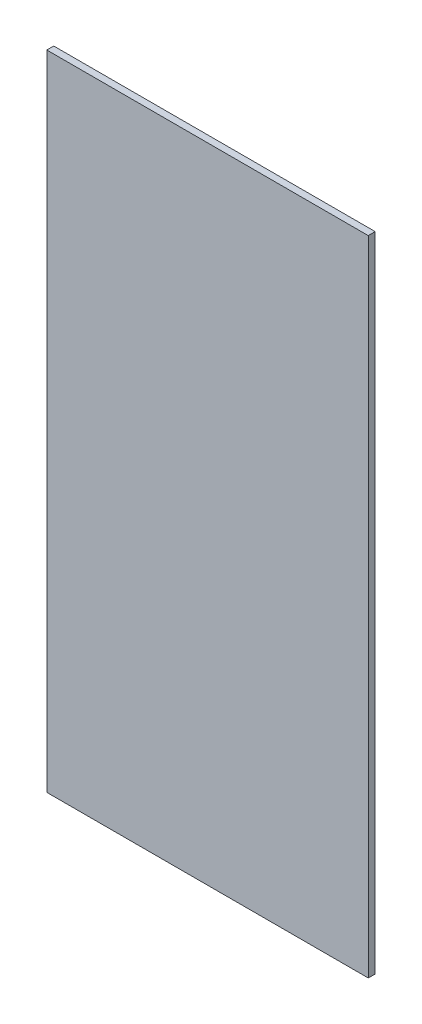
ISO-10303-21;
HEADER;
FILE_DESCRIPTION(('STEP AP214'),'2;1');
FILE_NAME('part.step','',(''),(''),'','','');
FILE_SCHEMA(('AUTOMOTIVE_DESIGN { 1 0 10303 214 1 1 1 1 }'));
ENDSEC;
DATA;
#1=APPLICATION_CONTEXT('core data for automotive mechanical design processes');
#2=APPLICATION_PROTOCOL_DEFINITION('international standard','automotive_design',2000,#1);
#3=PRODUCT_CONTEXT('',#1,'mechanical');
#4=PRODUCT('Part','Part','',(#3));
#5=PRODUCT_RELATED_PRODUCT_CATEGORY('part','',(#4));
#6=PRODUCT_DEFINITION_FORMATION('','',#4);
#7=PRODUCT_DEFINITION_CONTEXT('part definition',#1,'design');
#8=PRODUCT_DEFINITION('design','',#6,#7);
#9=PRODUCT_DEFINITION_SHAPE('','',#8);
#10=(LENGTH_UNIT() NAMED_UNIT(*) SI_UNIT(.MILLI.,.METRE.));
#11=(NAMED_UNIT(*) PLANE_ANGLE_UNIT() SI_UNIT($,.RADIAN.));
#12=(NAMED_UNIT(*) SI_UNIT($,.STERADIAN.) SOLID_ANGLE_UNIT());
#13=UNCERTAINTY_MEASURE_WITH_UNIT(LENGTH_MEASURE(1.E-05),#10,'distance_accuracy_value','');
#14=(GEOMETRIC_REPRESENTATION_CONTEXT(3) GLOBAL_UNCERTAINTY_ASSIGNED_CONTEXT((#13)) GLOBAL_UNIT_ASSIGNED_CONTEXT((#10,
#11,#12)) REPRESENTATION_CONTEXT('',''));
#15=CARTESIAN_POINT('',(0.,0.,0.));
#16=DIRECTION('',(0.,0.,1.));
#17=DIRECTION('',(1.,0.,0.));
#18=AXIS2_PLACEMENT_3D('',#15,#16,#17);
#19=CARTESIAN_POINT('',(0.,0.,0.));
#20=DIRECTION('',(0.,0.,1.));
#21=DIRECTION('',(1.,0.,0.));
#22=AXIS2_PLACEMENT_3D('',#19,#20,#21);
#23=PLANE('',#22);
#24=DIRECTION('',(0.,1.,0.));
#25=VECTOR('',#24,1.);
#26=CARTESIAN_POINT('',(277.5,0.,0.));
#27=LINE('',#26,#25);
#28=CARTESIAN_POINT('',(277.5,-567.5,0.));
#29=VERTEX_POINT('',#28);
#30=CARTESIAN_POINT('',(277.5,-447.5,0.));
#31=VERTEX_POINT('',#30);
#32=EDGE_CURVE('E656',#29,#31,#27,.T.);
#33=ORIENTED_EDGE('',*,*,#32,.F.);
#34=DIRECTION('',(-1.,0.,0.));
#35=VECTOR('',#34,1.);
#36=CARTESIAN_POINT('',(0.,-567.5,0.));
#37=LINE('',#36,#35);
#38=CARTESIAN_POINT('',(157.5,-567.5,0.));
#39=VERTEX_POINT('',#38);
#40=EDGE_CURVE('E736',#29,#39,#37,.T.);
#41=ORIENTED_EDGE('',*,*,#40,.T.);
#42=DIRECTION('',(0.,1.,0.));
#43=VECTOR('',#42,1.);
#44=CARTESIAN_POINT('',(157.5,0.,0.));
#45=LINE('',#44,#43);
#46=CARTESIAN_POINT('',(157.5,-447.5,0.));
#47=VERTEX_POINT('',#46);
#48=EDGE_CURVE('E652',#39,#47,#45,.T.);
#49=ORIENTED_EDGE('',*,*,#48,.T.);
#50=DIRECTION('',(1.,0.,0.));
#51=VECTOR('',#50,1.);
#52=CARTESIAN_POINT('',(0.,-447.5,0.));
#53=LINE('',#52,#51);
#54=EDGE_CURVE('E789',#47,#31,#53,.T.);
#55=ORIENTED_EDGE('',*,*,#54,.T.);
#56=EDGE_LOOP('',(#33,#41,#49,#55));
#57=FACE_BOUND('',#56,.T.);
#58=ADVANCED_FACE('F33',(#57),#23,.F.);
#59=DIRECTION('',(0.,1.,0.));
#60=VECTOR('',#59,1.);
#61=CARTESIAN_POINT('',(132.5,0.,0.));
#62=LINE('',#61,#60);
#63=CARTESIAN_POINT('',(132.5,-567.5,0.));
#64=VERTEX_POINT('',#63);
#65=CARTESIAN_POINT('',(132.5,-447.5,0.));
#66=VERTEX_POINT('',#65);
#67=EDGE_CURVE('E648',#64,#66,#62,.T.);
#68=ORIENTED_EDGE('',*,*,#67,.F.);
#69=DIRECTION('',(-1.,0.,0.));
#70=VECTOR('',#69,1.);
#71=CARTESIAN_POINT('',(0.,-567.5,0.));
#72=LINE('',#71,#70);
#73=CARTESIAN_POINT('',(12.5000000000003,-567.5,0.));
#74=VERTEX_POINT('',#73);
#75=EDGE_CURVE('E738',#64,#74,#72,.T.);
#76=ORIENTED_EDGE('',*,*,#75,.T.);
#77=DIRECTION('',(0.,1.,0.));
#78=VECTOR('',#77,1.);
#79=CARTESIAN_POINT('',(12.5000000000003,0.,0.));
#80=LINE('',#79,#78);
#81=CARTESIAN_POINT('',(12.5000000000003,-447.5,0.));
#82=VERTEX_POINT('',#81);
#83=EDGE_CURVE('E644',#74,#82,#80,.T.);
#84=ORIENTED_EDGE('',*,*,#83,.T.);
#85=DIRECTION('',(1.,0.,0.));
#86=VECTOR('',#85,1.);
#87=CARTESIAN_POINT('',(0.,-447.5,0.));
#88=LINE('',#87,#86);
#89=EDGE_CURVE('E794',#82,#66,#88,.T.);
#90=ORIENTED_EDGE('',*,*,#89,.T.);
#91=EDGE_LOOP('',(#68,#76,#84,#90));
#92=FACE_BOUND('',#91,.T.);
#93=ADVANCED_FACE('F1727',(#92),#23,.F.);
#94=DIRECTION('',(0.,1.,0.));
#95=VECTOR('',#94,1.);
#96=CARTESIAN_POINT('',(-12.5000000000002,0.,0.));
#97=LINE('',#96,#95);
#98=CARTESIAN_POINT('',(-12.5000000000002,-567.5,0.));
#99=VERTEX_POINT('',#98);
#100=CARTESIAN_POINT('',(-12.5000000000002,-447.5,0.));
#101=VERTEX_POINT('',#100);
#102=EDGE_CURVE('E640',#99,#101,#97,.T.);
#103=ORIENTED_EDGE('',*,*,#102,.F.);
#104=DIRECTION('',(-1.,0.,0.));
#105=VECTOR('',#104,1.);
#106=CARTESIAN_POINT('',(0.,-567.5,0.));
#107=LINE('',#106,#105);
#108=CARTESIAN_POINT('',(-132.5,-567.5,0.));
#109=VERTEX_POINT('',#108);
#110=EDGE_CURVE('E749',#99,#109,#107,.T.);
#111=ORIENTED_EDGE('',*,*,#110,.T.);
#112=DIRECTION('',(0.,1.,0.));
#113=VECTOR('',#112,1.);
#114=CARTESIAN_POINT('',(-132.5,0.,0.));
#115=LINE('',#114,#113);
#116=CARTESIAN_POINT('',(-132.5,-447.5,0.));
#117=VERTEX_POINT('',#116);
#118=EDGE_CURVE('E636',#109,#117,#115,.T.);
#119=ORIENTED_EDGE('',*,*,#118,.T.);
#120=DIRECTION('',(1.,0.,0.));
#121=VECTOR('',#120,1.);
#122=CARTESIAN_POINT('',(0.,-447.5,0.));
#123=LINE('',#122,#121);
#124=EDGE_CURVE('E803',#117,#101,#123,.T.);
#125=ORIENTED_EDGE('',*,*,#124,.T.);
#126=EDGE_LOOP('',(#103,#111,#119,#125));
#127=FACE_BOUND('',#126,.T.);
#128=ADVANCED_FACE('F1720',(#127),#23,.F.);
#129=DIRECTION('',(0.,1.,0.));
#130=VECTOR('',#129,1.);
#131=CARTESIAN_POINT('',(-157.5,0.,0.));
#132=LINE('',#131,#130);
#133=CARTESIAN_POINT('',(-157.5,-567.5,0.));
#134=VERTEX_POINT('',#133);
#135=CARTESIAN_POINT('',(-157.5,-447.5,0.));
#136=VERTEX_POINT('',#135);
#137=EDGE_CURVE('E632',#134,#136,#132,.T.);
#138=ORIENTED_EDGE('',*,*,#137,.F.);
#139=DIRECTION('',(-1.,0.,0.));
#140=VECTOR('',#139,1.);
#141=CARTESIAN_POINT('',(0.,-567.5,0.));
#142=LINE('',#141,#140);
#143=CARTESIAN_POINT('',(-277.5,-567.5,0.));
#144=VERTEX_POINT('',#143);
#145=EDGE_CURVE('E604',#134,#144,#142,.T.);
#146=ORIENTED_EDGE('',*,*,#145,.T.);
#147=DIRECTION('',(0.,1.,0.));
#148=VECTOR('',#147,1.);
#149=CARTESIAN_POINT('',(-277.5,0.,0.));
#150=LINE('',#149,#148);
#151=CARTESIAN_POINT('',(-277.5,-447.5,0.));
#152=VERTEX_POINT('',#151);
#153=EDGE_CURVE('E602',#144,#152,#150,.T.);
#154=ORIENTED_EDGE('',*,*,#153,.T.);
#155=DIRECTION('',(1.,0.,0.));
#156=VECTOR('',#155,1.);
#157=CARTESIAN_POINT('',(0.,-447.5,0.));
#158=LINE('',#157,#156);
#159=EDGE_CURVE('E812',#152,#136,#158,.T.);
#160=ORIENTED_EDGE('',*,*,#159,.T.);
#161=EDGE_LOOP('',(#138,#146,#154,#160));
#162=FACE_BOUND('',#161,.T.);
#163=ADVANCED_FACE('F1718',(#162),#23,.F.);
#164=CARTESIAN_POINT('',(-290.,-651.151247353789,12.5000000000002));
#165=DIRECTION('',(0.707106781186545,0.,0.70710678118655));
#166=DIRECTION('',(0.70710678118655,0.,-0.707106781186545));
#167=AXIS2_PLACEMENT_3D('',#164,#165,#166);
#168=PLANE('',#167);
#169=ORIENTED_EDGE('',*,*,#153,.F.);
#170=DIRECTION('',(-0.577350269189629,-0.577350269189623,0.577350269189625));
#171=VECTOR('',#170,1.);
#172=CARTESIAN_POINT('',(-313.717082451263,-603.717082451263,36.2170824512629));
#173=LINE('',#172,#171);
#174=CARTESIAN_POINT('',(-290.,-580.,12.5000000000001));
#175=VERTEX_POINT('',#174);
#176=EDGE_CURVE('E585',#144,#175,#173,.T.);
#177=ORIENTED_EDGE('',*,*,#176,.T.);
#178=DIRECTION('',(0.,1.,0.));
#179=VECTOR('',#178,1.);
#180=CARTESIAN_POINT('',(-290.,-651.151247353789,12.5000000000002));
#181=LINE('',#180,#179);
#182=CARTESIAN_POINT('',(-290.,-435.,12.5000000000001));
#183=VERTEX_POINT('',#182);
#184=EDGE_CURVE('E601',#175,#183,#181,.T.);
#185=ORIENTED_EDGE('',*,*,#184,.T.);
#186=DIRECTION('',(0.57735026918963,-0.577350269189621,-0.577350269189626));
#187=VECTOR('',#186,1.);
#188=CARTESIAN_POINT('',(-217.949584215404,-507.050415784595,-59.5504157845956));
#189=LINE('',#188,#187);
#190=EDGE_CURVE('E815',#183,#152,#189,.T.);
#191=ORIENTED_EDGE('',*,*,#190,.T.);
#192=EDGE_LOOP('',(#169,#177,#185,#191));
#193=FACE_BOUND('',#192,.T.);
#194=ADVANCED_FACE('F599',(#193),#168,.F.);
#195=CARTESIAN_POINT('',(-145.,-651.151247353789,12.5000000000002));
#196=DIRECTION('',(0.707106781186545,0.,0.70710678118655));
#197=DIRECTION('',(0.70710678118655,0.,-0.707106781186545));
#198=AXIS2_PLACEMENT_3D('',#195,#196,#197);
#199=PLANE('',#198);
#200=ORIENTED_EDGE('',*,*,#118,.F.);
#201=DIRECTION('',(-0.577350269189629,-0.577350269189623,0.577350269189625));
#202=VECTOR('',#201,1.);
#203=CARTESIAN_POINT('',(-168.717082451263,-603.717082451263,36.2170824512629));
#204=LINE('',#203,#202);
#205=CARTESIAN_POINT('',(-145.,-580.,12.5000000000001));
#206=VERTEX_POINT('',#205);
#207=EDGE_CURVE('E752',#109,#206,#204,.T.);
#208=ORIENTED_EDGE('',*,*,#207,.T.);
#209=DIRECTION('',(0.,1.,0.));
#210=VECTOR('',#209,1.);
#211=CARTESIAN_POINT('',(-145.,-651.151247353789,12.5000000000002));
#212=LINE('',#211,#210);
#213=CARTESIAN_POINT('',(-145.,-435.,12.5000000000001));
#214=VERTEX_POINT('',#213);
#215=EDGE_CURVE('E1289',#206,#214,#212,.T.);
#216=ORIENTED_EDGE('',*,*,#215,.T.);
#217=DIRECTION('',(0.57735026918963,-0.577350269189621,-0.577350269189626));
#218=VECTOR('',#217,1.);
#219=CARTESIAN_POINT('',(-72.9495842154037,-507.050415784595,-59.5504157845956));
#220=LINE('',#219,#218);
#221=EDGE_CURVE('E806',#214,#117,#220,.T.);
#222=ORIENTED_EDGE('',*,*,#221,.T.);
#223=EDGE_LOOP('',(#200,#208,#216,#222));
#224=FACE_BOUND('',#223,.T.);
#225=ADVANCED_FACE('F1710',(#224),#199,.F.);
#226=CARTESIAN_POINT('',(-145.,-651.151247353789,12.5000000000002));
#227=DIRECTION('',(0.707106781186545,0.,-0.70710678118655));
#228=DIRECTION('',(-0.70710678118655,0.,-0.707106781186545));
#229=AXIS2_PLACEMENT_3D('',#226,#227,#228);
#230=PLANE('',#229);
#231=DIRECTION('',(0.577350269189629,-0.577350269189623,0.577350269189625));
#232=VECTOR('',#231,1.);
#233=CARTESIAN_POINT('',(-121.282917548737,-603.717082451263,36.2170824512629));
#234=LINE('',#233,#232);
#235=EDGE_CURVE('E588',#134,#206,#234,.T.);
#236=ORIENTED_EDGE('',*,*,#235,.F.);
#237=ORIENTED_EDGE('',*,*,#137,.T.);
#238=DIRECTION('',(-0.57735026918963,-0.577350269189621,-0.577350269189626));
#239=VECTOR('',#238,1.);
#240=CARTESIAN_POINT('',(-217.050415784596,-507.050415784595,-59.5504157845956));
#241=LINE('',#240,#239);
#242=EDGE_CURVE('E809',#214,#136,#241,.T.);
#243=ORIENTED_EDGE('',*,*,#242,.F.);
#244=ORIENTED_EDGE('',*,*,#215,.F.);
#245=EDGE_LOOP('',(#236,#237,#243,#244));
#246=FACE_BOUND('',#245,.T.);
#247=ADVANCED_FACE('F1712',(#246),#230,.T.);
#248=CARTESIAN_POINT('',(0.,-651.151247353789,12.5000000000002));
#249=DIRECTION('',(0.707106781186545,0.,0.70710678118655));
#250=DIRECTION('',(0.70710678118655,0.,-0.707106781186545));
#251=AXIS2_PLACEMENT_3D('',#248,#249,#250);
#252=PLANE('',#251);
#253=ORIENTED_EDGE('',*,*,#83,.F.);
#254=DIRECTION('',(-0.577350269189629,-0.577350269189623,0.577350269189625));
#255=VECTOR('',#254,1.);
#256=CARTESIAN_POINT('',(-23.7170824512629,-603.717082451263,36.2170824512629));
#257=LINE('',#256,#255);
#258=CARTESIAN_POINT('',(0.,-580.,12.5000000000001));
#259=VERTEX_POINT('',#258);
#260=EDGE_CURVE('E745',#74,#259,#257,.T.);
#261=ORIENTED_EDGE('',*,*,#260,.T.);
#262=DIRECTION('',(0.,1.,0.));
#263=VECTOR('',#262,1.);
#264=CARTESIAN_POINT('',(0.,-651.151247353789,12.5000000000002));
#265=LINE('',#264,#263);
#266=CARTESIAN_POINT('',(0.,-435.,12.5000000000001));
#267=VERTEX_POINT('',#266);
#268=EDGE_CURVE('E1284',#259,#267,#265,.T.);
#269=ORIENTED_EDGE('',*,*,#268,.T.);
#270=DIRECTION('',(0.57735026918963,-0.577350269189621,-0.577350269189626));
#271=VECTOR('',#270,1.);
#272=CARTESIAN_POINT('',(72.0504157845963,-507.050415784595,-59.5504157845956));
#273=LINE('',#272,#271);
#274=EDGE_CURVE('E797',#267,#82,#273,.T.);
#275=ORIENTED_EDGE('',*,*,#274,.T.);
#276=EDGE_LOOP('',(#253,#261,#269,#275));
#277=FACE_BOUND('',#276,.T.);
#278=ADVANCED_FACE('F2223',(#277),#252,.F.);
#279=CARTESIAN_POINT('',(0.,-651.151247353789,12.5000000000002));
#280=DIRECTION('',(0.707106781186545,0.,-0.70710678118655));
#281=DIRECTION('',(-0.70710678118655,0.,-0.707106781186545));
#282=AXIS2_PLACEMENT_3D('',#279,#280,#281);
#283=PLANE('',#282);
#284=DIRECTION('',(0.577350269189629,-0.577350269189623,0.577350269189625));
#285=VECTOR('',#284,1.);
#286=CARTESIAN_POINT('',(23.7170824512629,-603.717082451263,36.2170824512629));
#287=LINE('',#286,#285);
#288=EDGE_CURVE('E747',#99,#259,#287,.T.);
#289=ORIENTED_EDGE('',*,*,#288,.F.);
#290=ORIENTED_EDGE('',*,*,#102,.T.);
#291=DIRECTION('',(-0.57735026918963,-0.577350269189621,-0.577350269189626));
#292=VECTOR('',#291,1.);
#293=CARTESIAN_POINT('',(-72.0504157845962,-507.050415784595,-59.5504157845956));
#294=LINE('',#293,#292);
#295=EDGE_CURVE('E800',#267,#101,#294,.T.);
#296=ORIENTED_EDGE('',*,*,#295,.F.);
#297=ORIENTED_EDGE('',*,*,#268,.F.);
#298=EDGE_LOOP('',(#289,#290,#296,#297));
#299=FACE_BOUND('',#298,.T.);
#300=ADVANCED_FACE('F2217',(#299),#283,.T.);
#301=CARTESIAN_POINT('',(145.,-651.151247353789,12.5000000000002));
#302=DIRECTION('',(0.707106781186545,0.,0.70710678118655));
#303=DIRECTION('',(0.70710678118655,0.,-0.707106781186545));
#304=AXIS2_PLACEMENT_3D('',#301,#302,#303);
#305=PLANE('',#304);
#306=ORIENTED_EDGE('',*,*,#48,.F.);
#307=DIRECTION('',(-0.577350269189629,-0.577350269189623,0.577350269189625));
#308=VECTOR('',#307,1.);
#309=CARTESIAN_POINT('',(121.282917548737,-603.717082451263,36.2170824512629));
#310=LINE('',#309,#308);
#311=CARTESIAN_POINT('',(145.,-580.,12.5000000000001));
#312=VERTEX_POINT('',#311);
#313=EDGE_CURVE('E732',#39,#312,#310,.T.);
#314=ORIENTED_EDGE('',*,*,#313,.T.);
#315=DIRECTION('',(0.,1.,0.));
#316=VECTOR('',#315,1.);
#317=CARTESIAN_POINT('',(145.,-651.151247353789,12.5000000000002));
#318=LINE('',#317,#316);
#319=CARTESIAN_POINT('',(145.,-435.,12.5000000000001));
#320=VERTEX_POINT('',#319);
#321=EDGE_CURVE('E717',#312,#320,#318,.T.);
#322=ORIENTED_EDGE('',*,*,#321,.T.);
#323=DIRECTION('',(0.57735026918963,-0.577350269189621,-0.577350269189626));
#324=VECTOR('',#323,1.);
#325=CARTESIAN_POINT('',(217.050415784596,-507.050415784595,-59.5504157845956));
#326=LINE('',#325,#324);
#327=EDGE_CURVE('E791',#320,#47,#326,.T.);
#328=ORIENTED_EDGE('',*,*,#327,.T.);
#329=EDGE_LOOP('',(#306,#314,#322,#328));
#330=FACE_BOUND('',#329,.T.);
#331=ADVANCED_FACE('F733',(#330),#305,.F.);
#332=CARTESIAN_POINT('',(145.,-651.151247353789,12.5000000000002));
#333=DIRECTION('',(0.707106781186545,0.,-0.70710678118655));
#334=DIRECTION('',(-0.70710678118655,0.,-0.707106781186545));
#335=AXIS2_PLACEMENT_3D('',#332,#333,#334);
#336=PLANE('',#335);
#337=DIRECTION('',(0.577350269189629,-0.577350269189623,0.577350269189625));
#338=VECTOR('',#337,1.);
#339=CARTESIAN_POINT('',(168.717082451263,-603.717082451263,36.2170824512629));
#340=LINE('',#339,#338);
#341=EDGE_CURVE('E720',#64,#312,#340,.T.);
#342=ORIENTED_EDGE('',*,*,#341,.F.);
#343=ORIENTED_EDGE('',*,*,#67,.T.);
#344=DIRECTION('',(-0.57735026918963,-0.577350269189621,-0.577350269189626));
#345=VECTOR('',#344,1.);
#346=CARTESIAN_POINT('',(72.9495842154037,-507.050415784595,-59.5504157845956));
#347=LINE('',#346,#345);
#348=EDGE_CURVE('E723',#320,#66,#347,.T.);
#349=ORIENTED_EDGE('',*,*,#348,.F.);
#350=ORIENTED_EDGE('',*,*,#321,.F.);
#351=EDGE_LOOP('',(#342,#343,#349,#350));
#352=FACE_BOUND('',#351,.T.);
#353=ADVANCED_FACE('F719',(#352),#336,.T.);
#354=CARTESIAN_POINT('',(290.,-651.151247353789,12.5000000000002));
#355=DIRECTION('',(0.707106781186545,0.,-0.70710678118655));
#356=DIRECTION('',(-0.70710678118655,0.,-0.707106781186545));
#357=AXIS2_PLACEMENT_3D('',#354,#355,#356);
#358=PLANE('',#357);
#359=DIRECTION('',(0.577350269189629,-0.577350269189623,0.577350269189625));
#360=VECTOR('',#359,1.);
#361=CARTESIAN_POINT('',(313.717082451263,-603.717082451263,36.2170824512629));
#362=LINE('',#361,#360);
#363=CARTESIAN_POINT('',(290.,-580.,12.5000000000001));
#364=VERTEX_POINT('',#363);
#365=EDGE_CURVE('E593',#29,#364,#362,.T.);
#366=ORIENTED_EDGE('',*,*,#365,.F.);
#367=ORIENTED_EDGE('',*,*,#32,.T.);
#368=DIRECTION('',(-0.57735026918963,-0.577350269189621,-0.577350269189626));
#369=VECTOR('',#368,1.);
#370=CARTESIAN_POINT('',(217.949584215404,-507.050415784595,-59.5504157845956));
#371=LINE('',#370,#369);
#372=CARTESIAN_POINT('',(290.,-435.,12.5000000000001));
#373=VERTEX_POINT('',#372);
#374=EDGE_CURVE('E698',#373,#31,#371,.T.);
#375=ORIENTED_EDGE('',*,*,#374,.F.);
#376=DIRECTION('',(0.,1.,0.));
#377=VECTOR('',#376,1.);
#378=CARTESIAN_POINT('',(290.,-651.151247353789,12.5000000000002));
#379=LINE('',#378,#377);
#380=EDGE_CURVE('E1280',#364,#373,#379,.T.);
#381=ORIENTED_EDGE('',*,*,#380,.F.);
#382=EDGE_LOOP('',(#366,#367,#375,#381));
#383=FACE_BOUND('',#382,.T.);
#384=ADVANCED_FACE('F1418',(#383),#358,.T.);
#385=CARTESIAN_POINT('',(277.5,-422.5,0.));
#386=VERTEX_POINT('',#385);
#387=CARTESIAN_POINT('',(277.5,-302.5,0.));
#388=VERTEX_POINT('',#387);
#389=EDGE_CURVE('E659',#386,#388,#27,.T.);
#390=ORIENTED_EDGE('',*,*,#389,.F.);
#391=DIRECTION('',(-1.,0.,0.));
#392=VECTOR('',#391,1.);
#393=CARTESIAN_POINT('',(0.,-422.5,0.));
#394=LINE('',#393,#392);
#395=CARTESIAN_POINT('',(157.5,-422.5,0.));
#396=VERTEX_POINT('',#395);
#397=EDGE_CURVE('E49',#386,#396,#394,.T.);
#398=ORIENTED_EDGE('',*,*,#397,.T.);
#399=CARTESIAN_POINT('',(157.5,-302.5,0.));
#400=VERTEX_POINT('',#399);
#401=EDGE_CURVE('E655',#396,#400,#45,.T.);
#402=ORIENTED_EDGE('',*,*,#401,.T.);
#403=DIRECTION('',(1.,0.,0.));
#404=VECTOR('',#403,1.);
#405=CARTESIAN_POINT('',(0.,-302.5,0.));
#406=LINE('',#405,#404);
#407=EDGE_CURVE('E853',#400,#388,#406,.T.);
#408=ORIENTED_EDGE('',*,*,#407,.T.);
#409=EDGE_LOOP('',(#390,#398,#402,#408));
#410=FACE_BOUND('',#409,.T.);
#411=ADVANCED_FACE('F1365',(#410),#23,.F.);
#412=CARTESIAN_POINT('',(132.5,-422.5,0.));
#413=VERTEX_POINT('',#412);
#414=CARTESIAN_POINT('',(132.5,-302.5,0.));
#415=VERTEX_POINT('',#414);
#416=EDGE_CURVE('E651',#413,#415,#62,.T.);
#417=ORIENTED_EDGE('',*,*,#416,.F.);
#418=DIRECTION('',(-1.,0.,0.));
#419=VECTOR('',#418,1.);
#420=CARTESIAN_POINT('',(0.,-422.5,0.));
#421=LINE('',#420,#419);
#422=CARTESIAN_POINT('',(12.5000000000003,-422.5,0.));
#423=VERTEX_POINT('',#422);
#424=EDGE_CURVE('E765',#413,#423,#421,.T.);
#425=ORIENTED_EDGE('',*,*,#424,.T.);
#426=CARTESIAN_POINT('',(12.5000000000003,-302.5,0.));
#427=VERTEX_POINT('',#426);
#428=EDGE_CURVE('E647',#423,#427,#80,.T.);
#429=ORIENTED_EDGE('',*,*,#428,.T.);
#430=DIRECTION('',(1.,0.,0.));
#431=VECTOR('',#430,1.);
#432=CARTESIAN_POINT('',(0.,-302.5,0.));
#433=LINE('',#432,#431);
#434=EDGE_CURVE('E862',#427,#415,#433,.T.);
#435=ORIENTED_EDGE('',*,*,#434,.T.);
#436=EDGE_LOOP('',(#417,#425,#429,#435));
#437=FACE_BOUND('',#436,.T.);
#438=ADVANCED_FACE('F1732',(#437),#23,.F.);
#439=CARTESIAN_POINT('',(-12.5000000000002,-422.5,0.));
#440=VERTEX_POINT('',#439);
#441=CARTESIAN_POINT('',(-12.5000000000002,-302.5,0.));
#442=VERTEX_POINT('',#441);
#443=EDGE_CURVE('E643',#440,#442,#97,.T.);
#444=ORIENTED_EDGE('',*,*,#443,.F.);
#445=DIRECTION('',(-1.,0.,0.));
#446=VECTOR('',#445,1.);
#447=CARTESIAN_POINT('',(0.,-422.5,0.));
#448=LINE('',#447,#446);
#449=CARTESIAN_POINT('',(-132.5,-422.5,0.));
#450=VERTEX_POINT('',#449);
#451=EDGE_CURVE('E774',#440,#450,#448,.T.);
#452=ORIENTED_EDGE('',*,*,#451,.T.);
#453=CARTESIAN_POINT('',(-132.5,-302.5,0.));
#454=VERTEX_POINT('',#453);
#455=EDGE_CURVE('E639',#450,#454,#115,.T.);
#456=ORIENTED_EDGE('',*,*,#455,.T.);
#457=DIRECTION('',(1.,0.,0.));
#458=VECTOR('',#457,1.);
#459=CARTESIAN_POINT('',(0.,-302.5,0.));
#460=LINE('',#459,#458);
#461=EDGE_CURVE('E871',#454,#442,#460,.T.);
#462=ORIENTED_EDGE('',*,*,#461,.T.);
#463=EDGE_LOOP('',(#444,#452,#456,#462));
#464=FACE_BOUND('',#463,.T.);
#465=ADVANCED_FACE('F2244',(#464),#23,.F.);
#466=CARTESIAN_POINT('',(-157.5,-422.5,0.));
#467=VERTEX_POINT('',#466);
#468=CARTESIAN_POINT('',(-157.5,-302.5,0.));
#469=VERTEX_POINT('',#468);
#470=EDGE_CURVE('E635',#467,#469,#132,.T.);
#471=ORIENTED_EDGE('',*,*,#470,.F.);
#472=DIRECTION('',(-1.,0.,0.));
#473=VECTOR('',#472,1.);
#474=CARTESIAN_POINT('',(0.,-422.5,0.));
#475=LINE('',#474,#473);
#476=CARTESIAN_POINT('',(-277.5,-422.5,0.));
#477=VERTEX_POINT('',#476);
#478=EDGE_CURVE('E783',#467,#477,#475,.T.);
#479=ORIENTED_EDGE('',*,*,#478,.T.);
#480=CARTESIAN_POINT('',(-277.5,-302.5,0.));
#481=VERTEX_POINT('',#480);
#482=EDGE_CURVE('E631',#477,#481,#150,.T.);
#483=ORIENTED_EDGE('',*,*,#482,.T.);
#484=DIRECTION('',(1.,0.,0.));
#485=VECTOR('',#484,1.);
#486=CARTESIAN_POINT('',(0.,-302.5,0.));
#487=LINE('',#486,#485);
#488=EDGE_CURVE('E880',#481,#469,#487,.T.);
#489=ORIENTED_EDGE('',*,*,#488,.T.);
#490=EDGE_LOOP('',(#471,#479,#483,#489));
#491=FACE_BOUND('',#490,.T.);
#492=ADVANCED_FACE('F1695',(#491),#23,.F.);
#493=ORIENTED_EDGE('',*,*,#482,.F.);
#494=DIRECTION('',(-0.577350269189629,-0.577350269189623,0.577350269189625));
#495=VECTOR('',#494,1.);
#496=CARTESIAN_POINT('',(-362.050415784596,-507.050415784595,84.5504157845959));
#497=LINE('',#496,#495);
#498=EDGE_CURVE('E786',#477,#183,#497,.T.);
#499=ORIENTED_EDGE('',*,*,#498,.T.);
#500=CARTESIAN_POINT('',(-290.,-290.,12.5000000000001));
#501=VERTEX_POINT('',#500);
#502=EDGE_CURVE('E612',#183,#501,#181,.T.);
#503=ORIENTED_EDGE('',*,*,#502,.T.);
#504=DIRECTION('',(0.57735026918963,-0.577350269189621,-0.577350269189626));
#505=VECTOR('',#504,1.);
#506=CARTESIAN_POINT('',(-169.61625088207,-410.383749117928,-107.883749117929));
#507=LINE('',#506,#505);
#508=EDGE_CURVE('E883',#501,#481,#507,.T.);
#509=ORIENTED_EDGE('',*,*,#508,.T.);
#510=EDGE_LOOP('',(#493,#499,#503,#509));
#511=FACE_BOUND('',#510,.T.);
#512=ADVANCED_FACE('F1689',(#511),#168,.F.);
#513=ORIENTED_EDGE('',*,*,#455,.F.);
#514=DIRECTION('',(-0.577350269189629,-0.577350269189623,0.577350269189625));
#515=VECTOR('',#514,1.);
#516=CARTESIAN_POINT('',(-217.050415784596,-507.050415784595,84.5504157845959));
#517=LINE('',#516,#515);
#518=EDGE_CURVE('E777',#450,#214,#517,.T.);
#519=ORIENTED_EDGE('',*,*,#518,.T.);
#520=CARTESIAN_POINT('',(-145.,-290.,12.5000000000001));
#521=VERTEX_POINT('',#520);
#522=EDGE_CURVE('E1291',#214,#521,#212,.T.);
#523=ORIENTED_EDGE('',*,*,#522,.T.);
#524=DIRECTION('',(0.57735026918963,-0.577350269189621,-0.577350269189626));
#525=VECTOR('',#524,1.);
#526=CARTESIAN_POINT('',(-24.6162508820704,-410.383749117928,-107.883749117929));
#527=LINE('',#526,#525);
#528=EDGE_CURVE('E874',#521,#454,#527,.T.);
#529=ORIENTED_EDGE('',*,*,#528,.T.);
#530=EDGE_LOOP('',(#513,#519,#523,#529));
#531=FACE_BOUND('',#530,.T.);
#532=ADVANCED_FACE('F1620',(#531),#199,.F.);
#533=DIRECTION('',(0.577350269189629,-0.577350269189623,0.577350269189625));
#534=VECTOR('',#533,1.);
#535=CARTESIAN_POINT('',(-72.9495842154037,-507.050415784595,84.550415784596));
#536=LINE('',#535,#534);
#537=EDGE_CURVE('E780',#467,#214,#536,.T.);
#538=ORIENTED_EDGE('',*,*,#537,.F.);
#539=ORIENTED_EDGE('',*,*,#470,.T.);
#540=DIRECTION('',(-0.57735026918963,-0.577350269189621,-0.577350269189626));
#541=VECTOR('',#540,1.);
#542=CARTESIAN_POINT('',(-265.383749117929,-410.383749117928,-107.883749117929));
#543=LINE('',#542,#541);
#544=EDGE_CURVE('E877',#521,#469,#543,.T.);
#545=ORIENTED_EDGE('',*,*,#544,.F.);
#546=ORIENTED_EDGE('',*,*,#522,.F.);
#547=EDGE_LOOP('',(#538,#539,#545,#546));
#548=FACE_BOUND('',#547,.T.);
#549=ADVANCED_FACE('F1696',(#548),#230,.T.);
#550=ORIENTED_EDGE('',*,*,#428,.F.);
#551=DIRECTION('',(-0.577350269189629,-0.577350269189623,0.577350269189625));
#552=VECTOR('',#551,1.);
#553=CARTESIAN_POINT('',(-72.0504157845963,-507.050415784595,84.5504157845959));
#554=LINE('',#553,#552);
#555=EDGE_CURVE('E768',#423,#267,#554,.T.);
#556=ORIENTED_EDGE('',*,*,#555,.T.);
#557=CARTESIAN_POINT('',(0.,-290.,12.5000000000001));
#558=VERTEX_POINT('',#557);
#559=EDGE_CURVE('E1288',#267,#558,#265,.T.);
#560=ORIENTED_EDGE('',*,*,#559,.T.);
#561=DIRECTION('',(0.57735026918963,-0.577350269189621,-0.577350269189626));
#562=VECTOR('',#561,1.);
#563=CARTESIAN_POINT('',(120.38374911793,-410.383749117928,-107.883749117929));
#564=LINE('',#563,#562);
#565=EDGE_CURVE('E865',#558,#427,#564,.T.);
#566=ORIENTED_EDGE('',*,*,#565,.T.);
#567=EDGE_LOOP('',(#550,#556,#560,#566));
#568=FACE_BOUND('',#567,.T.);
#569=ADVANCED_FACE('F1501',(#568),#252,.F.);
#570=DIRECTION('',(0.577350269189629,-0.577350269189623,0.577350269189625));
#571=VECTOR('',#570,1.);
#572=CARTESIAN_POINT('',(72.0504157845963,-507.050415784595,84.550415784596));
#573=LINE('',#572,#571);
#574=EDGE_CURVE('E771',#440,#267,#573,.T.);
#575=ORIENTED_EDGE('',*,*,#574,.F.);
#576=ORIENTED_EDGE('',*,*,#443,.T.);
#577=DIRECTION('',(-0.57735026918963,-0.577350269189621,-0.577350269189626));
#578=VECTOR('',#577,1.);
#579=CARTESIAN_POINT('',(-120.38374911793,-410.383749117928,-107.883749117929));
#580=LINE('',#579,#578);
#581=EDGE_CURVE('E868',#558,#442,#580,.T.);
#582=ORIENTED_EDGE('',*,*,#581,.F.);
#583=ORIENTED_EDGE('',*,*,#559,.F.);
#584=EDGE_LOOP('',(#575,#576,#582,#583));
#585=FACE_BOUND('',#584,.T.);
#586=ADVANCED_FACE('F1526',(#585),#283,.T.);
#587=ORIENTED_EDGE('',*,*,#401,.F.);
#588=DIRECTION('',(-0.577350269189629,-0.577350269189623,0.577350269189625));
#589=VECTOR('',#588,1.);
#590=CARTESIAN_POINT('',(72.9495842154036,-507.050415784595,84.5504157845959));
#591=LINE('',#590,#589);
#592=EDGE_CURVE('E760',#396,#320,#591,.T.);
#593=ORIENTED_EDGE('',*,*,#592,.T.);
#594=CARTESIAN_POINT('',(145.,-290.,12.5000000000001));
#595=VERTEX_POINT('',#594);
#596=EDGE_CURVE('E728',#320,#595,#318,.T.);
#597=ORIENTED_EDGE('',*,*,#596,.T.);
#598=DIRECTION('',(0.57735026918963,-0.577350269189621,-0.577350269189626));
#599=VECTOR('',#598,1.);
#600=CARTESIAN_POINT('',(265.383749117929,-410.383749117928,-107.883749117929));
#601=LINE('',#600,#599);
#602=EDGE_CURVE('E856',#595,#400,#601,.T.);
#603=ORIENTED_EDGE('',*,*,#602,.T.);
#604=EDGE_LOOP('',(#587,#593,#597,#603));
#605=FACE_BOUND('',#604,.T.);
#606=ADVANCED_FACE('F2135',(#605),#305,.F.);
#607=DIRECTION('',(0.577350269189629,-0.577350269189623,0.577350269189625));
#608=VECTOR('',#607,1.);
#609=CARTESIAN_POINT('',(217.050415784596,-507.050415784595,84.550415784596));
#610=LINE('',#609,#608);
#611=EDGE_CURVE('E762',#413,#320,#610,.T.);
#612=ORIENTED_EDGE('',*,*,#611,.F.);
#613=ORIENTED_EDGE('',*,*,#416,.T.);
#614=DIRECTION('',(-0.57735026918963,-0.577350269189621,-0.577350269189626));
#615=VECTOR('',#614,1.);
#616=CARTESIAN_POINT('',(24.6162508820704,-410.383749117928,-107.883749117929));
#617=LINE('',#616,#615);
#618=EDGE_CURVE('E859',#595,#415,#617,.T.);
#619=ORIENTED_EDGE('',*,*,#618,.F.);
#620=ORIENTED_EDGE('',*,*,#596,.F.);
#621=EDGE_LOOP('',(#612,#613,#619,#620));
#622=FACE_BOUND('',#621,.T.);
#623=ADVANCED_FACE('F2127',(#622),#336,.T.);
#624=DIRECTION('',(0.577350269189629,-0.577350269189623,0.577350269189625));
#625=VECTOR('',#624,1.);
#626=CARTESIAN_POINT('',(362.050415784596,-507.050415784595,84.550415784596));
#627=LINE('',#626,#625);
#628=EDGE_CURVE('E697',#386,#373,#627,.T.);
#629=ORIENTED_EDGE('',*,*,#628,.F.);
#630=ORIENTED_EDGE('',*,*,#389,.T.);
#631=DIRECTION('',(-0.57735026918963,-0.577350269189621,-0.577350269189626));
#632=VECTOR('',#631,1.);
#633=CARTESIAN_POINT('',(169.61625088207,-410.383749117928,-107.883749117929));
#634=LINE('',#633,#632);
#635=CARTESIAN_POINT('',(290.,-290.,12.5000000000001));
#636=VERTEX_POINT('',#635);
#637=EDGE_CURVE('E694',#636,#388,#634,.T.);
#638=ORIENTED_EDGE('',*,*,#637,.F.);
#639=EDGE_CURVE('E1282',#373,#636,#379,.T.);
#640=ORIENTED_EDGE('',*,*,#639,.F.);
#641=EDGE_LOOP('',(#629,#630,#638,#640));
#642=FACE_BOUND('',#641,.T.);
#643=ADVANCED_FACE('F1355',(#642),#358,.T.);
#644=CARTESIAN_POINT('',(277.5,-277.5,0.));
#645=VERTEX_POINT('',#644);
#646=CARTESIAN_POINT('',(277.5,-157.5,0.));
#647=VERTEX_POINT('',#646);
#648=EDGE_CURVE('E1344',#645,#647,#27,.T.);
#649=ORIENTED_EDGE('',*,*,#648,.F.);
#650=DIRECTION('',(-1.,0.,0.));
#651=VECTOR('',#650,1.);
#652=CARTESIAN_POINT('',(0.,-277.5,0.));
#653=LINE('',#652,#651);
#654=CARTESIAN_POINT('',(157.5,-277.5,0.));
#655=VERTEX_POINT('',#654);
#656=EDGE_CURVE('E57',#645,#655,#653,.T.);
#657=ORIENTED_EDGE('',*,*,#656,.T.);
#658=CARTESIAN_POINT('',(157.5,-157.5,0.));
#659=VERTEX_POINT('',#658);
#660=EDGE_CURVE('E1368',#655,#659,#45,.T.);
#661=ORIENTED_EDGE('',*,*,#660,.T.);
#662=DIRECTION('',(1.,0.,0.));
#663=VECTOR('',#662,1.);
#664=CARTESIAN_POINT('',(0.,-157.5,0.));
#665=LINE('',#664,#663);
#666=EDGE_CURVE('E924',#659,#647,#665,.T.);
#667=ORIENTED_EDGE('',*,*,#666,.T.);
#668=EDGE_LOOP('',(#649,#657,#661,#667));
#669=FACE_BOUND('',#668,.T.);
#670=ADVANCED_FACE('F2187',(#669),#23,.F.);
#671=CARTESIAN_POINT('',(132.5,-277.5,0.));
#672=VERTEX_POINT('',#671);
#673=CARTESIAN_POINT('',(132.5,-157.5,0.));
#674=VERTEX_POINT('',#673);
#675=EDGE_CURVE('E2945',#672,#674,#62,.T.);
#676=ORIENTED_EDGE('',*,*,#675,.F.);
#677=DIRECTION('',(-1.,0.,0.));
#678=VECTOR('',#677,1.);
#679=CARTESIAN_POINT('',(0.,-277.5,0.));
#680=LINE('',#679,#678);
#681=CARTESIAN_POINT('',(12.5000000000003,-277.5,0.));
#682=VERTEX_POINT('',#681);
#683=EDGE_CURVE('E829',#672,#682,#680,.T.);
#684=ORIENTED_EDGE('',*,*,#683,.T.);
#685=CARTESIAN_POINT('',(12.5000000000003,-157.5,0.));
#686=VERTEX_POINT('',#685);
#687=EDGE_CURVE('E1530',#682,#686,#80,.T.);
#688=ORIENTED_EDGE('',*,*,#687,.T.);
#689=DIRECTION('',(1.,0.,0.));
#690=VECTOR('',#689,1.);
#691=CARTESIAN_POINT('',(0.,-157.5,0.));
#692=LINE('',#691,#690);
#693=EDGE_CURVE('E933',#686,#674,#692,.T.);
#694=ORIENTED_EDGE('',*,*,#693,.T.);
#695=EDGE_LOOP('',(#676,#684,#688,#694));
#696=FACE_BOUND('',#695,.T.);
#697=ADVANCED_FACE('F2179',(#696),#23,.F.);
#698=CARTESIAN_POINT('',(-12.5000000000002,-277.5,0.));
#699=VERTEX_POINT('',#698);
#700=CARTESIAN_POINT('',(-12.5000000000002,-157.5,0.));
#701=VERTEX_POINT('',#700);
#702=EDGE_CURVE('E1533',#699,#701,#97,.T.);
#703=ORIENTED_EDGE('',*,*,#702,.F.);
#704=DIRECTION('',(-1.,0.,0.));
#705=VECTOR('',#704,1.);
#706=CARTESIAN_POINT('',(0.,-277.5,0.));
#707=LINE('',#706,#705);
#708=CARTESIAN_POINT('',(-132.5,-277.5,0.));
#709=VERTEX_POINT('',#708);
#710=EDGE_CURVE('E838',#699,#709,#707,.T.);
#711=ORIENTED_EDGE('',*,*,#710,.T.);
#712=CARTESIAN_POINT('',(-132.5,-157.5,0.));
#713=VERTEX_POINT('',#712);
#714=EDGE_CURVE('E3026',#709,#713,#115,.T.);
#715=ORIENTED_EDGE('',*,*,#714,.T.);
#716=DIRECTION('',(1.,0.,0.));
#717=VECTOR('',#716,1.);
#718=CARTESIAN_POINT('',(0.,-157.5,0.));
#719=LINE('',#718,#717);
#720=EDGE_CURVE('E942',#713,#701,#719,.T.);
#721=ORIENTED_EDGE('',*,*,#720,.T.);
#722=EDGE_LOOP('',(#703,#711,#715,#721));
#723=FACE_BOUND('',#722,.T.);
#724=ADVANCED_FACE('F2172',(#723),#23,.F.);
#725=CARTESIAN_POINT('',(-157.5,-277.5,0.));
#726=VERTEX_POINT('',#725);
#727=CARTESIAN_POINT('',(-157.5,-157.5,0.));
#728=VERTEX_POINT('',#727);
#729=EDGE_CURVE('E1635',#726,#728,#132,.T.);
#730=ORIENTED_EDGE('',*,*,#729,.F.);
#731=DIRECTION('',(-1.,0.,0.));
#732=VECTOR('',#731,1.);
#733=CARTESIAN_POINT('',(0.,-277.5,0.));
#734=LINE('',#733,#732);
#735=CARTESIAN_POINT('',(-277.5,-277.5,0.));
#736=VERTEX_POINT('',#735);
#737=EDGE_CURVE('E847',#726,#736,#734,.T.);
#738=ORIENTED_EDGE('',*,*,#737,.T.);
#739=CARTESIAN_POINT('',(-277.5,-157.5,0.));
#740=VERTEX_POINT('',#739);
#741=EDGE_CURVE('E2986',#736,#740,#150,.T.);
#742=ORIENTED_EDGE('',*,*,#741,.T.);
#743=DIRECTION('',(1.,0.,0.));
#744=VECTOR('',#743,1.);
#745=CARTESIAN_POINT('',(0.,-157.5,0.));
#746=LINE('',#745,#744);
#747=EDGE_CURVE('E951',#740,#728,#746,.T.);
#748=ORIENTED_EDGE('',*,*,#747,.T.);
#749=EDGE_LOOP('',(#730,#738,#742,#748));
#750=FACE_BOUND('',#749,.T.);
#751=ADVANCED_FACE('F1637',(#750),#23,.F.);
#752=ORIENTED_EDGE('',*,*,#741,.F.);
#753=DIRECTION('',(-0.577350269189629,-0.577350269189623,0.577350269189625));
#754=VECTOR('',#753,1.);
#755=CARTESIAN_POINT('',(-410.38374911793,-410.383749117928,132.883749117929));
#756=LINE('',#755,#754);
#757=EDGE_CURVE('E850',#736,#501,#756,.T.);
#758=ORIENTED_EDGE('',*,*,#757,.T.);
#759=CARTESIAN_POINT('',(-290.,-145.,12.5000000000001));
#760=VERTEX_POINT('',#759);
#761=EDGE_CURVE('E1681',#501,#760,#181,.T.);
#762=ORIENTED_EDGE('',*,*,#761,.T.);
#763=DIRECTION('',(0.57735026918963,-0.577350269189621,-0.577350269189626));
#764=VECTOR('',#763,1.);
#765=CARTESIAN_POINT('',(-121.282917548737,-313.71708245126,-156.217082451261));
#766=LINE('',#765,#764);
#767=EDGE_CURVE('E954',#760,#740,#766,.T.);
#768=ORIENTED_EDGE('',*,*,#767,.T.);
#769=EDGE_LOOP('',(#752,#758,#762,#768));
#770=FACE_BOUND('',#769,.T.);
#771=ADVANCED_FACE('F2088',(#770),#168,.F.);
#772=ORIENTED_EDGE('',*,*,#714,.F.);
#773=DIRECTION('',(-0.577350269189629,-0.577350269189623,0.577350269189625));
#774=VECTOR('',#773,1.);
#775=CARTESIAN_POINT('',(-265.38374911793,-410.383749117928,132.883749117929));
#776=LINE('',#775,#774);
#777=EDGE_CURVE('E841',#709,#521,#776,.T.);
#778=ORIENTED_EDGE('',*,*,#777,.T.);
#779=CARTESIAN_POINT('',(-145.,-145.,12.5000000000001));
#780=VERTEX_POINT('',#779);
#781=EDGE_CURVE('E1612',#521,#780,#212,.T.);
#782=ORIENTED_EDGE('',*,*,#781,.T.);
#783=DIRECTION('',(0.57735026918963,-0.577350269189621,-0.577350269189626));
#784=VECTOR('',#783,1.);
#785=CARTESIAN_POINT('',(23.7170824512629,-313.71708245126,-156.217082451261));
#786=LINE('',#785,#784);
#787=EDGE_CURVE('E945',#780,#713,#786,.T.);
#788=ORIENTED_EDGE('',*,*,#787,.T.);
#789=EDGE_LOOP('',(#772,#778,#782,#788));
#790=FACE_BOUND('',#789,.T.);
#791=ADVANCED_FACE('F2082',(#790),#199,.F.);
#792=DIRECTION('',(0.577350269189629,-0.577350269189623,0.577350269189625));
#793=VECTOR('',#792,1.);
#794=CARTESIAN_POINT('',(-24.6162508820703,-410.383749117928,132.883749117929));
#795=LINE('',#794,#793);
#796=EDGE_CURVE('E844',#726,#521,#795,.T.);
#797=ORIENTED_EDGE('',*,*,#796,.F.);
#798=ORIENTED_EDGE('',*,*,#729,.T.);
#799=DIRECTION('',(-0.57735026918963,-0.577350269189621,-0.577350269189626));
#800=VECTOR('',#799,1.);
#801=CARTESIAN_POINT('',(-313.717082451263,-313.71708245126,-156.217082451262));
#802=LINE('',#801,#800);
#803=EDGE_CURVE('E948',#780,#728,#802,.T.);
#804=ORIENTED_EDGE('',*,*,#803,.F.);
#805=ORIENTED_EDGE('',*,*,#781,.F.);
#806=EDGE_LOOP('',(#797,#798,#804,#805));
#807=FACE_BOUND('',#806,.T.);
#808=ADVANCED_FACE('F1633',(#807),#230,.T.);
#809=ORIENTED_EDGE('',*,*,#687,.F.);
#810=DIRECTION('',(-0.577350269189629,-0.577350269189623,0.577350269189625));
#811=VECTOR('',#810,1.);
#812=CARTESIAN_POINT('',(-120.38374911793,-410.383749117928,132.883749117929));
#813=LINE('',#812,#811);
#814=EDGE_CURVE('E832',#682,#558,#813,.T.);
#815=ORIENTED_EDGE('',*,*,#814,.T.);
#816=CARTESIAN_POINT('',(-1.2490009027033E-13,-145.,12.5000000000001));
#817=VERTEX_POINT('',#816);
#818=EDGE_CURVE('E1490',#558,#817,#265,.T.);
#819=ORIENTED_EDGE('',*,*,#818,.T.);
#820=DIRECTION('',(0.57735026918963,-0.577350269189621,-0.577350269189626));
#821=VECTOR('',#820,1.);
#822=CARTESIAN_POINT('',(168.717082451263,-313.71708245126,-156.217082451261));
#823=LINE('',#822,#821);
#824=EDGE_CURVE('E936',#817,#686,#823,.T.);
#825=ORIENTED_EDGE('',*,*,#824,.T.);
#826=EDGE_LOOP('',(#809,#815,#819,#825));
#827=FACE_BOUND('',#826,.T.);
#828=ADVANCED_FACE('F1529',(#827),#252,.F.);
#829=DIRECTION('',(0.577350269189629,-0.577350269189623,0.577350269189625));
#830=VECTOR('',#829,1.);
#831=CARTESIAN_POINT('',(120.38374911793,-410.383749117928,132.883749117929));
#832=LINE('',#831,#830);
#833=EDGE_CURVE('E835',#699,#558,#832,.T.);
#834=ORIENTED_EDGE('',*,*,#833,.F.);
#835=ORIENTED_EDGE('',*,*,#702,.T.);
#836=DIRECTION('',(-0.57735026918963,-0.577350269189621,-0.577350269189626));
#837=VECTOR('',#836,1.);
#838=CARTESIAN_POINT('',(-168.717082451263,-313.71708245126,-156.217082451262));
#839=LINE('',#838,#837);
#840=EDGE_CURVE('E939',#817,#701,#839,.T.);
#841=ORIENTED_EDGE('',*,*,#840,.F.);
#842=ORIENTED_EDGE('',*,*,#818,.F.);
#843=EDGE_LOOP('',(#834,#835,#841,#842));
#844=FACE_BOUND('',#843,.T.);
#845=ADVANCED_FACE('F1532',(#844),#283,.T.);
#846=ORIENTED_EDGE('',*,*,#660,.F.);
#847=DIRECTION('',(-0.577350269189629,-0.577350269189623,0.577350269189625));
#848=VECTOR('',#847,1.);
#849=CARTESIAN_POINT('',(24.6162508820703,-410.383749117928,132.883749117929));
#850=LINE('',#849,#848);
#851=EDGE_CURVE('E823',#655,#595,#850,.T.);
#852=ORIENTED_EDGE('',*,*,#851,.T.);
#853=CARTESIAN_POINT('',(145.,-145.,12.5000000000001));
#854=VERTEX_POINT('',#853);
#855=EDGE_CURVE('E3015',#595,#854,#318,.T.);
#856=ORIENTED_EDGE('',*,*,#855,.T.);
#857=DIRECTION('',(0.57735026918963,-0.577350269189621,-0.577350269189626));
#858=VECTOR('',#857,1.);
#859=CARTESIAN_POINT('',(313.717082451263,-313.71708245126,-156.217082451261));
#860=LINE('',#859,#858);
#861=EDGE_CURVE('E927',#854,#659,#860,.T.);
#862=ORIENTED_EDGE('',*,*,#861,.T.);
#863=EDGE_LOOP('',(#846,#852,#856,#862));
#864=FACE_BOUND('',#863,.T.);
#865=ADVANCED_FACE('F2061',(#864),#305,.F.);
#866=DIRECTION('',(0.577350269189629,-0.577350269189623,0.577350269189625));
#867=VECTOR('',#866,1.);
#868=CARTESIAN_POINT('',(265.38374911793,-410.383749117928,132.883749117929));
#869=LINE('',#868,#867);
#870=EDGE_CURVE('E826',#672,#595,#869,.T.);
#871=ORIENTED_EDGE('',*,*,#870,.F.);
#872=ORIENTED_EDGE('',*,*,#675,.T.);
#873=DIRECTION('',(-0.57735026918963,-0.577350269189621,-0.577350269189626));
#874=VECTOR('',#873,1.);
#875=CARTESIAN_POINT('',(-23.7170824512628,-313.71708245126,-156.217082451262));
#876=LINE('',#875,#874);
#877=EDGE_CURVE('E930',#854,#674,#876,.T.);
#878=ORIENTED_EDGE('',*,*,#877,.F.);
#879=ORIENTED_EDGE('',*,*,#855,.F.);
#880=EDGE_LOOP('',(#871,#872,#878,#879));
#881=FACE_BOUND('',#880,.T.);
#882=ADVANCED_FACE('F2054',(#881),#336,.T.);
#883=DIRECTION('',(0.577350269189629,-0.577350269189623,0.577350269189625));
#884=VECTOR('',#883,1.);
#885=CARTESIAN_POINT('',(410.38374911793,-410.383749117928,132.883749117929));
#886=LINE('',#885,#884);
#887=EDGE_CURVE('E692',#645,#636,#886,.T.);
#888=ORIENTED_EDGE('',*,*,#887,.F.);
#889=ORIENTED_EDGE('',*,*,#648,.T.);
#890=DIRECTION('',(-0.57735026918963,-0.577350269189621,-0.577350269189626));
#891=VECTOR('',#890,1.);
#892=CARTESIAN_POINT('',(121.282917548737,-313.71708245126,-156.217082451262));
#893=LINE('',#892,#891);
#894=CARTESIAN_POINT('',(290.,-145.,12.5000000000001));
#895=VERTEX_POINT('',#894);
#896=EDGE_CURVE('E689',#895,#647,#893,.T.);
#897=ORIENTED_EDGE('',*,*,#896,.F.);
#898=EDGE_CURVE('E1420',#636,#895,#379,.T.);
#899=ORIENTED_EDGE('',*,*,#898,.F.);
#900=EDGE_LOOP('',(#888,#889,#897,#899));
#901=FACE_BOUND('',#900,.T.);
#902=ADVANCED_FACE('F2048',(#901),#358,.T.);
#903=CARTESIAN_POINT('',(277.5,-132.5,0.));
#904=VERTEX_POINT('',#903);
#905=CARTESIAN_POINT('',(277.5,-12.5000000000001,0.));
#906=VERTEX_POINT('',#905);
#907=EDGE_CURVE('E1339',#904,#906,#27,.T.);
#908=ORIENTED_EDGE('',*,*,#907,.F.);
#909=DIRECTION('',(-1.,0.,0.));
#910=VECTOR('',#909,1.);
#911=CARTESIAN_POINT('',(0.,-132.5,0.));
#912=LINE('',#911,#910);
#913=CARTESIAN_POINT('',(157.5,-132.5,0.));
#914=VERTEX_POINT('',#913);
#915=EDGE_CURVE('E890',#904,#914,#912,.T.);
#916=ORIENTED_EDGE('',*,*,#915,.T.);
#917=CARTESIAN_POINT('',(157.5,-12.5,0.));
#918=VERTEX_POINT('',#917);
#919=EDGE_CURVE('E1369',#914,#918,#45,.T.);
#920=ORIENTED_EDGE('',*,*,#919,.T.);
#921=DIRECTION('',(1.,0.,0.));
#922=VECTOR('',#921,1.);
#923=CARTESIAN_POINT('',(0.,-12.5,0.));
#924=LINE('',#923,#922);
#925=EDGE_CURVE('E995',#918,#906,#924,.T.);
#926=ORIENTED_EDGE('',*,*,#925,.T.);
#927=EDGE_LOOP('',(#908,#916,#920,#926));
#928=FACE_BOUND('',#927,.T.);
#929=ADVANCED_FACE('F2108',(#928),#23,.F.);
#930=CARTESIAN_POINT('',(132.5,-132.5,0.));
#931=VERTEX_POINT('',#930);
#932=CARTESIAN_POINT('',(132.5,-12.5000000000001,0.));
#933=VERTEX_POINT('',#932);
#934=EDGE_CURVE('E2941',#931,#933,#62,.T.);
#935=ORIENTED_EDGE('',*,*,#934,.F.);
#936=DIRECTION('',(-1.,0.,0.));
#937=VECTOR('',#936,1.);
#938=CARTESIAN_POINT('',(0.,-132.5,0.));
#939=LINE('',#938,#937);
#940=CARTESIAN_POINT('',(12.5000000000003,-132.5,0.));
#941=VERTEX_POINT('',#940);
#942=EDGE_CURVE('E900',#931,#941,#939,.T.);
#943=ORIENTED_EDGE('',*,*,#942,.T.);
#944=CARTESIAN_POINT('',(12.5000000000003,-12.5,0.));
#945=VERTEX_POINT('',#944);
#946=EDGE_CURVE('E1538',#941,#945,#80,.T.);
#947=ORIENTED_EDGE('',*,*,#946,.T.);
#948=DIRECTION('',(1.,0.,0.));
#949=VECTOR('',#948,1.);
#950=CARTESIAN_POINT('',(0.,-12.5,0.));
#951=LINE('',#950,#949);
#952=EDGE_CURVE('E1004',#945,#933,#951,.T.);
#953=ORIENTED_EDGE('',*,*,#952,.T.);
#954=EDGE_LOOP('',(#935,#943,#947,#953));
#955=FACE_BOUND('',#954,.T.);
#956=ADVANCED_FACE('F2101',(#955),#23,.F.);
#957=CARTESIAN_POINT('',(-12.5000000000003,-132.5,0.));
#958=VERTEX_POINT('',#957);
#959=CARTESIAN_POINT('',(-12.5000000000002,-12.5000000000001,0.));
#960=VERTEX_POINT('',#959);
#961=EDGE_CURVE('E1546',#958,#960,#97,.T.);
#962=ORIENTED_EDGE('',*,*,#961,.F.);
#963=DIRECTION('',(-1.,0.,0.));
#964=VECTOR('',#963,1.);
#965=CARTESIAN_POINT('',(0.,-132.5,0.));
#966=LINE('',#965,#964);
#967=CARTESIAN_POINT('',(-132.5,-132.5,0.));
#968=VERTEX_POINT('',#967);
#969=EDGE_CURVE('E909',#958,#968,#966,.T.);
#970=ORIENTED_EDGE('',*,*,#969,.T.);
#971=CARTESIAN_POINT('',(-132.5,-12.5,0.));
#972=VERTEX_POINT('',#971);
#973=EDGE_CURVE('E2991',#968,#972,#115,.T.);
#974=ORIENTED_EDGE('',*,*,#973,.T.);
#975=DIRECTION('',(1.,0.,0.));
#976=VECTOR('',#975,1.);
#977=CARTESIAN_POINT('',(0.,-12.5,0.));
#978=LINE('',#977,#976);
#979=EDGE_CURVE('E1013',#972,#960,#978,.T.);
#980=ORIENTED_EDGE('',*,*,#979,.T.);
#981=EDGE_LOOP('',(#962,#970,#974,#980));
#982=FACE_BOUND('',#981,.T.);
#983=ADVANCED_FACE('F2094',(#982),#23,.F.);
#984=CARTESIAN_POINT('',(-157.5,-132.5,0.));
#985=VERTEX_POINT('',#984);
#986=CARTESIAN_POINT('',(-157.5,-12.5000000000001,0.));
#987=VERTEX_POINT('',#986);
#988=EDGE_CURVE('E1640',#985,#987,#132,.T.);
#989=ORIENTED_EDGE('',*,*,#988,.F.);
#990=DIRECTION('',(-1.,0.,0.));
#991=VECTOR('',#990,1.);
#992=CARTESIAN_POINT('',(0.,-132.5,0.));
#993=LINE('',#992,#991);
#994=CARTESIAN_POINT('',(-277.5,-132.5,0.));
#995=VERTEX_POINT('',#994);
#996=EDGE_CURVE('E918',#985,#995,#993,.T.);
#997=ORIENTED_EDGE('',*,*,#996,.T.);
#998=CARTESIAN_POINT('',(-277.5,-12.5,0.));
#999=VERTEX_POINT('',#998);
#1000=EDGE_CURVE('E2983',#995,#999,#150,.T.);
#1001=ORIENTED_EDGE('',*,*,#1000,.T.);
#1002=DIRECTION('',(1.,0.,0.));
#1003=VECTOR('',#1002,1.);
#1004=CARTESIAN_POINT('',(0.,-12.5,0.));
#1005=LINE('',#1004,#1003);
#1006=EDGE_CURVE('E1022',#999,#987,#1005,.T.);
#1007=ORIENTED_EDGE('',*,*,#1006,.T.);
#1008=EDGE_LOOP('',(#989,#997,#1001,#1007));
#1009=FACE_BOUND('',#1008,.T.);
#1010=ADVANCED_FACE('F2040',(#1009),#23,.F.);
#1011=ORIENTED_EDGE('',*,*,#1000,.F.);
#1012=DIRECTION('',(-0.577350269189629,-0.577350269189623,0.577350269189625));
#1013=VECTOR('',#1012,1.);
#1014=CARTESIAN_POINT('',(-458.717082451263,-313.717082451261,181.217082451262));
#1015=LINE('',#1014,#1013);
#1016=EDGE_CURVE('E921',#995,#760,#1015,.T.);
#1017=ORIENTED_EDGE('',*,*,#1016,.T.);
#1018=CARTESIAN_POINT('',(-290.,0.,12.5000000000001));
#1019=VERTEX_POINT('',#1018);
#1020=EDGE_CURVE('E1677',#760,#1019,#181,.T.);
#1021=ORIENTED_EDGE('',*,*,#1020,.T.);
#1022=DIRECTION('',(0.57735026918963,-0.577350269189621,-0.577350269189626));
#1023=VECTOR('',#1022,1.);
#1024=CARTESIAN_POINT('',(-72.9495842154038,-217.050415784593,-204.550415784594));
#1025=LINE('',#1024,#1023);
#1026=EDGE_CURVE('E1025',#1019,#999,#1025,.T.);
#1027=ORIENTED_EDGE('',*,*,#1026,.T.);
#1028=EDGE_LOOP('',(#1011,#1017,#1021,#1027));
#1029=FACE_BOUND('',#1028,.T.);
#1030=ADVANCED_FACE('F2009',(#1029),#168,.F.);
#1031=ORIENTED_EDGE('',*,*,#973,.F.);
#1032=DIRECTION('',(-0.577350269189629,-0.577350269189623,0.577350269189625));
#1033=VECTOR('',#1032,1.);
#1034=CARTESIAN_POINT('',(-313.717082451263,-313.717082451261,181.217082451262));
#1035=LINE('',#1034,#1033);
#1036=EDGE_CURVE('E912',#968,#780,#1035,.T.);
#1037=ORIENTED_EDGE('',*,*,#1036,.T.);
#1038=CARTESIAN_POINT('',(-145.,0.,12.5000000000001));
#1039=VERTEX_POINT('',#1038);
#1040=EDGE_CURVE('E1609',#780,#1039,#212,.T.);
#1041=ORIENTED_EDGE('',*,*,#1040,.T.);
#1042=DIRECTION('',(0.57735026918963,-0.577350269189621,-0.577350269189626));
#1043=VECTOR('',#1042,1.);
#1044=CARTESIAN_POINT('',(72.0504157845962,-217.050415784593,-204.550415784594));
#1045=LINE('',#1044,#1043);
#1046=EDGE_CURVE('E1016',#1039,#972,#1045,.T.);
#1047=ORIENTED_EDGE('',*,*,#1046,.T.);
#1048=EDGE_LOOP('',(#1031,#1037,#1041,#1047));
#1049=FACE_BOUND('',#1048,.T.);
#1050=ADVANCED_FACE('F2002',(#1049),#199,.F.);
#1051=DIRECTION('',(0.577350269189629,-0.577350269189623,0.577350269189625));
#1052=VECTOR('',#1051,1.);
#1053=CARTESIAN_POINT('',(23.717082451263,-313.717082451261,181.217082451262));
#1054=LINE('',#1053,#1052);
#1055=EDGE_CURVE('E915',#985,#780,#1054,.T.);
#1056=ORIENTED_EDGE('',*,*,#1055,.F.);
#1057=ORIENTED_EDGE('',*,*,#988,.T.);
#1058=DIRECTION('',(-0.57735026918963,-0.577350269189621,-0.577350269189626));
#1059=VECTOR('',#1058,1.);
#1060=CARTESIAN_POINT('',(-362.050415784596,-217.050415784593,-204.550415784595));
#1061=LINE('',#1060,#1059);
#1062=EDGE_CURVE('E1019',#1039,#987,#1061,.T.);
#1063=ORIENTED_EDGE('',*,*,#1062,.F.);
#1064=ORIENTED_EDGE('',*,*,#1040,.F.);
#1065=EDGE_LOOP('',(#1056,#1057,#1063,#1064));
#1066=FACE_BOUND('',#1065,.T.);
#1067=ADVANCED_FACE('F1995',(#1066),#230,.T.);
#1068=ORIENTED_EDGE('',*,*,#946,.F.);
#1069=DIRECTION('',(-0.577350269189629,-0.577350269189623,0.577350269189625));
#1070=VECTOR('',#1069,1.);
#1071=CARTESIAN_POINT('',(-168.717082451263,-313.717082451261,181.217082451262));
#1072=LINE('',#1071,#1070);
#1073=EDGE_CURVE('E903',#941,#817,#1072,.T.);
#1074=ORIENTED_EDGE('',*,*,#1073,.T.);
#1075=CARTESIAN_POINT('',(-1.11022302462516E-13,0.,12.5000000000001));
#1076=VERTEX_POINT('',#1075);
#1077=EDGE_CURVE('E1486',#817,#1076,#265,.T.);
#1078=ORIENTED_EDGE('',*,*,#1077,.T.);
#1079=DIRECTION('',(0.57735026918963,-0.577350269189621,-0.577350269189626));
#1080=VECTOR('',#1079,1.);
#1081=CARTESIAN_POINT('',(217.050415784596,-217.050415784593,-204.550415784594));
#1082=LINE('',#1081,#1080);
#1083=EDGE_CURVE('E1007',#1076,#945,#1082,.T.);
#1084=ORIENTED_EDGE('',*,*,#1083,.T.);
#1085=EDGE_LOOP('',(#1068,#1074,#1078,#1084));
#1086=FACE_BOUND('',#1085,.T.);
#1087=ADVANCED_FACE('F1537',(#1086),#252,.F.);
#1088=DIRECTION('',(0.577350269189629,-0.577350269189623,0.577350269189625));
#1089=VECTOR('',#1088,1.);
#1090=CARTESIAN_POINT('',(168.717082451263,-313.717082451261,181.217082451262));
#1091=LINE('',#1090,#1089);
#1092=EDGE_CURVE('E906',#958,#817,#1091,.T.);
#1093=ORIENTED_EDGE('',*,*,#1092,.F.);
#1094=ORIENTED_EDGE('',*,*,#961,.T.);
#1095=DIRECTION('',(-0.57735026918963,-0.577350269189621,-0.577350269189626));
#1096=VECTOR('',#1095,1.);
#1097=CARTESIAN_POINT('',(-217.050415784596,-217.050415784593,-204.550415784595));
#1098=LINE('',#1097,#1096);
#1099=EDGE_CURVE('E1010',#1076,#960,#1098,.T.);
#1100=ORIENTED_EDGE('',*,*,#1099,.F.);
#1101=ORIENTED_EDGE('',*,*,#1077,.F.);
#1102=EDGE_LOOP('',(#1093,#1094,#1100,#1101));
#1103=FACE_BOUND('',#1102,.T.);
#1104=ADVANCED_FACE('F1544',(#1103),#283,.T.);
#1105=ORIENTED_EDGE('',*,*,#919,.F.);
#1106=DIRECTION('',(-0.577350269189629,-0.577350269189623,0.577350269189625));
#1107=VECTOR('',#1106,1.);
#1108=CARTESIAN_POINT('',(-23.7170824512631,-313.717082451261,181.217082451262));
#1109=LINE('',#1108,#1107);
#1110=EDGE_CURVE('E894',#914,#854,#1109,.T.);
#1111=ORIENTED_EDGE('',*,*,#1110,.T.);
#1112=CARTESIAN_POINT('',(145.,0.,12.5000000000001));
#1113=VERTEX_POINT('',#1112);
#1114=EDGE_CURVE('E3012',#854,#1113,#318,.T.);
#1115=ORIENTED_EDGE('',*,*,#1114,.T.);
#1116=DIRECTION('',(0.57735026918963,-0.577350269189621,-0.577350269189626));
#1117=VECTOR('',#1116,1.);
#1118=CARTESIAN_POINT('',(362.050415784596,-217.050415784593,-204.550415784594));
#1119=LINE('',#1118,#1117);
#1120=EDGE_CURVE('E998',#1113,#918,#1119,.T.);
#1121=ORIENTED_EDGE('',*,*,#1120,.T.);
#1122=EDGE_LOOP('',(#1105,#1111,#1115,#1121));
#1123=FACE_BOUND('',#1122,.T.);
#1124=ADVANCED_FACE('F1976',(#1123),#305,.F.);
#1125=DIRECTION('',(0.577350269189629,-0.577350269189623,0.577350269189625));
#1126=VECTOR('',#1125,1.);
#1127=CARTESIAN_POINT('',(313.717082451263,-313.717082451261,181.217082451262));
#1128=LINE('',#1127,#1126);
#1129=EDGE_CURVE('E897',#931,#854,#1128,.T.);
#1130=ORIENTED_EDGE('',*,*,#1129,.F.);
#1131=ORIENTED_EDGE('',*,*,#934,.T.);
#1132=DIRECTION('',(-0.57735026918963,-0.577350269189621,-0.577350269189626));
#1133=VECTOR('',#1132,1.);
#1134=CARTESIAN_POINT('',(-72.0504157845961,-217.050415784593,-204.550415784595));
#1135=LINE('',#1134,#1133);
#1136=EDGE_CURVE('E1001',#1113,#933,#1135,.T.);
#1137=ORIENTED_EDGE('',*,*,#1136,.F.);
#1138=ORIENTED_EDGE('',*,*,#1114,.F.);
#1139=EDGE_LOOP('',(#1130,#1131,#1137,#1138));
#1140=FACE_BOUND('',#1139,.T.);
#1141=ADVANCED_FACE('F1968',(#1140),#336,.T.);
#1142=DIRECTION('',(0.577350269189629,-0.577350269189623,0.577350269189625));
#1143=VECTOR('',#1142,1.);
#1144=CARTESIAN_POINT('',(458.717082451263,-313.717082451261,181.217082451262));
#1145=LINE('',#1144,#1143);
#1146=EDGE_CURVE('E686',#904,#895,#1145,.T.);
#1147=ORIENTED_EDGE('',*,*,#1146,.F.);
#1148=ORIENTED_EDGE('',*,*,#907,.T.);
#1149=DIRECTION('',(-0.57735026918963,-0.577350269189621,-0.577350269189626));
#1150=VECTOR('',#1149,1.);
#1151=CARTESIAN_POINT('',(72.9495842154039,-217.050415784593,-204.550415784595));
#1152=LINE('',#1151,#1150);
#1153=CARTESIAN_POINT('',(290.,0.,12.5000000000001));
#1154=VERTEX_POINT('',#1153);
#1155=EDGE_CURVE('E683',#1154,#906,#1152,.T.);
#1156=ORIENTED_EDGE('',*,*,#1155,.F.);
#1157=EDGE_CURVE('E1421',#895,#1154,#379,.T.);
#1158=ORIENTED_EDGE('',*,*,#1157,.F.);
#1159=EDGE_LOOP('',(#1147,#1148,#1156,#1158));
#1160=FACE_BOUND('',#1159,.T.);
#1161=ADVANCED_FACE('F1961',(#1160),#358,.T.);
#1162=CARTESIAN_POINT('',(277.5,12.5000000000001,0.));
#1163=VERTEX_POINT('',#1162);
#1164=CARTESIAN_POINT('',(277.5,132.5,0.));
#1165=VERTEX_POINT('',#1164);
#1166=EDGE_CURVE('E1334',#1163,#1165,#27,.T.);
#1167=ORIENTED_EDGE('',*,*,#1166,.F.);
#1168=DIRECTION('',(-1.,0.,0.));
#1169=VECTOR('',#1168,1.);
#1170=CARTESIAN_POINT('',(0.,12.5000000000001,0.));
#1171=LINE('',#1170,#1169);
#1172=CARTESIAN_POINT('',(157.5,12.5000000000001,0.));
#1173=VERTEX_POINT('',#1172);
#1174=EDGE_CURVE('E961',#1163,#1173,#1171,.T.);
#1175=ORIENTED_EDGE('',*,*,#1174,.T.);
#1176=CARTESIAN_POINT('',(157.5,132.5,0.));
#1177=VERTEX_POINT('',#1176);
#1178=EDGE_CURVE('E1373',#1173,#1177,#45,.T.);
#1179=ORIENTED_EDGE('',*,*,#1178,.T.);
#1180=DIRECTION('',(1.,0.,0.));
#1181=VECTOR('',#1180,1.);
#1182=CARTESIAN_POINT('',(0.,132.5,0.));
#1183=LINE('',#1182,#1181);
#1184=EDGE_CURVE('E1066',#1177,#1165,#1183,.T.);
#1185=ORIENTED_EDGE('',*,*,#1184,.T.);
#1186=EDGE_LOOP('',(#1167,#1175,#1179,#1185));
#1187=FACE_BOUND('',#1186,.T.);
#1188=ADVANCED_FACE('F2032',(#1187),#23,.F.);
#1189=CARTESIAN_POINT('',(132.5,12.5000000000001,0.));
#1190=VERTEX_POINT('',#1189);
#1191=CARTESIAN_POINT('',(132.5,132.5,0.));
#1192=VERTEX_POINT('',#1191);
#1193=EDGE_CURVE('E2938',#1190,#1192,#62,.T.);
#1194=ORIENTED_EDGE('',*,*,#1193,.F.);
#1195=DIRECTION('',(-1.,0.,0.));
#1196=VECTOR('',#1195,1.);
#1197=CARTESIAN_POINT('',(0.,12.5000000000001,0.));
#1198=LINE('',#1197,#1196);
#1199=CARTESIAN_POINT('',(12.5000000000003,12.5000000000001,0.));
#1200=VERTEX_POINT('',#1199);
#1201=EDGE_CURVE('E971',#1190,#1200,#1198,.T.);
#1202=ORIENTED_EDGE('',*,*,#1201,.T.);
#1203=CARTESIAN_POINT('',(12.5000000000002,132.5,0.));
#1204=VERTEX_POINT('',#1203);
#1205=EDGE_CURVE('E1468',#1200,#1204,#80,.T.);
#1206=ORIENTED_EDGE('',*,*,#1205,.T.);
#1207=DIRECTION('',(1.,0.,0.));
#1208=VECTOR('',#1207,1.);
#1209=CARTESIAN_POINT('',(0.,132.5,0.));
#1210=LINE('',#1209,#1208);
#1211=EDGE_CURVE('E1075',#1204,#1192,#1210,.T.);
#1212=ORIENTED_EDGE('',*,*,#1211,.T.);
#1213=EDGE_LOOP('',(#1194,#1202,#1206,#1212));
#1214=FACE_BOUND('',#1213,.T.);
#1215=ADVANCED_FACE('F2024',(#1214),#23,.F.);
#1216=CARTESIAN_POINT('',(-12.5000000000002,12.5000000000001,0.));
#1217=VERTEX_POINT('',#1216);
#1218=CARTESIAN_POINT('',(-12.5000000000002,132.5,0.));
#1219=VERTEX_POINT('',#1218);
#1220=EDGE_CURVE('E1558',#1217,#1219,#97,.T.);
#1221=ORIENTED_EDGE('',*,*,#1220,.F.);
#1222=DIRECTION('',(-1.,0.,0.));
#1223=VECTOR('',#1222,1.);
#1224=CARTESIAN_POINT('',(0.,12.5000000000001,0.));
#1225=LINE('',#1224,#1223);
#1226=CARTESIAN_POINT('',(-132.5,12.5000000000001,0.));
#1227=VERTEX_POINT('',#1226);
#1228=EDGE_CURVE('E980',#1217,#1227,#1225,.T.);
#1229=ORIENTED_EDGE('',*,*,#1228,.T.);
#1230=CARTESIAN_POINT('',(-132.5,132.5,0.));
#1231=VERTEX_POINT('',#1230);
#1232=EDGE_CURVE('E1593',#1227,#1231,#115,.T.);
#1233=ORIENTED_EDGE('',*,*,#1232,.T.);
#1234=DIRECTION('',(1.,0.,0.));
#1235=VECTOR('',#1234,1.);
#1236=CARTESIAN_POINT('',(0.,132.5,0.));
#1237=LINE('',#1236,#1235);
#1238=EDGE_CURVE('E1084',#1231,#1219,#1237,.T.);
#1239=ORIENTED_EDGE('',*,*,#1238,.T.);
#1240=EDGE_LOOP('',(#1221,#1229,#1233,#1239));
#1241=FACE_BOUND('',#1240,.T.);
#1242=ADVANCED_FACE('F2016',(#1241),#23,.F.);
#1243=CARTESIAN_POINT('',(-157.5,12.5000000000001,0.));
#1244=VERTEX_POINT('',#1243);
#1245=CARTESIAN_POINT('',(-157.5,132.5,0.));
#1246=VERTEX_POINT('',#1245);
#1247=EDGE_CURVE('E1641',#1244,#1246,#132,.T.);
#1248=ORIENTED_EDGE('',*,*,#1247,.F.);
#1249=DIRECTION('',(-1.,0.,0.));
#1250=VECTOR('',#1249,1.);
#1251=CARTESIAN_POINT('',(0.,12.5000000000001,0.));
#1252=LINE('',#1251,#1250);
#1253=CARTESIAN_POINT('',(-277.5,12.5000000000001,0.));
#1254=VERTEX_POINT('',#1253);
#1255=EDGE_CURVE('E989',#1244,#1254,#1252,.T.);
#1256=ORIENTED_EDGE('',*,*,#1255,.T.);
#1257=CARTESIAN_POINT('',(-277.5,132.5,0.));
#1258=VERTEX_POINT('',#1257);
#1259=EDGE_CURVE('E2981',#1254,#1258,#150,.T.);
#1260=ORIENTED_EDGE('',*,*,#1259,.T.);
#1261=DIRECTION('',(1.,0.,0.));
#1262=VECTOR('',#1261,1.);
#1263=CARTESIAN_POINT('',(0.,132.5,0.));
#1264=LINE('',#1263,#1262);
#1265=EDGE_CURVE('E1093',#1258,#1246,#1264,.T.);
#1266=ORIENTED_EDGE('',*,*,#1265,.T.);
#1267=EDGE_LOOP('',(#1248,#1256,#1260,#1266));
#1268=FACE_BOUND('',#1267,.T.);
#1269=ADVANCED_FACE('F1954',(#1268),#23,.F.);
#1270=ORIENTED_EDGE('',*,*,#1259,.F.);
#1271=DIRECTION('',(-0.577350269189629,-0.577350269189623,0.577350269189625));
#1272=VECTOR('',#1271,1.);
#1273=CARTESIAN_POINT('',(-507.050415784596,-217.050415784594,229.550415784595));
#1274=LINE('',#1273,#1272);
#1275=EDGE_CURVE('E992',#1254,#1019,#1274,.T.);
#1276=ORIENTED_EDGE('',*,*,#1275,.T.);
#1277=CARTESIAN_POINT('',(-290.,145.,12.5000000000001));
#1278=VERTEX_POINT('',#1277);
#1279=EDGE_CURVE('E1673',#1019,#1278,#181,.T.);
#1280=ORIENTED_EDGE('',*,*,#1279,.T.);
#1281=DIRECTION('',(0.57735026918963,-0.577350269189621,-0.577350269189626));
#1282=VECTOR('',#1281,1.);
#1283=CARTESIAN_POINT('',(-24.6162508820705,-120.383749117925,-252.883749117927));
#1284=LINE('',#1283,#1282);
#1285=EDGE_CURVE('E1096',#1278,#1258,#1284,.T.);
#1286=ORIENTED_EDGE('',*,*,#1285,.T.);
#1287=EDGE_LOOP('',(#1270,#1276,#1280,#1286));
#1288=FACE_BOUND('',#1287,.T.);
#1289=ADVANCED_FACE('F1927',(#1288),#168,.F.);
#1290=ORIENTED_EDGE('',*,*,#1232,.F.);
#1291=DIRECTION('',(-0.577350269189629,-0.577350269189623,0.577350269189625));
#1292=VECTOR('',#1291,1.);
#1293=CARTESIAN_POINT('',(-362.050415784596,-217.050415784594,229.550415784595));
#1294=LINE('',#1293,#1292);
#1295=EDGE_CURVE('E983',#1227,#1039,#1294,.T.);
#1296=ORIENTED_EDGE('',*,*,#1295,.T.);
#1297=CARTESIAN_POINT('',(-145.,145.,12.5000000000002));
#1298=VERTEX_POINT('',#1297);
#1299=EDGE_CURVE('E1606',#1039,#1298,#212,.T.);
#1300=ORIENTED_EDGE('',*,*,#1299,.T.);
#1301=DIRECTION('',(0.57735026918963,-0.577350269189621,-0.577350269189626));
#1302=VECTOR('',#1301,1.);
#1303=CARTESIAN_POINT('',(120.38374911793,-120.383749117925,-252.883749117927));
#1304=LINE('',#1303,#1302);
#1305=EDGE_CURVE('E1087',#1298,#1231,#1304,.T.);
#1306=ORIENTED_EDGE('',*,*,#1305,.T.);
#1307=EDGE_LOOP('',(#1290,#1296,#1300,#1306));
#1308=FACE_BOUND('',#1307,.T.);
#1309=ADVANCED_FACE('F1921',(#1308),#199,.F.);
#1310=DIRECTION('',(0.577350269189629,-0.577350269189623,0.577350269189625));
#1311=VECTOR('',#1310,1.);
#1312=CARTESIAN_POINT('',(72.0504157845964,-217.050415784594,229.550415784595));
#1313=LINE('',#1312,#1311);
#1314=EDGE_CURVE('E986',#1244,#1039,#1313,.T.);
#1315=ORIENTED_EDGE('',*,*,#1314,.F.);
#1316=ORIENTED_EDGE('',*,*,#1247,.T.);
#1317=DIRECTION('',(-0.57735026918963,-0.577350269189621,-0.577350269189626));
#1318=VECTOR('',#1317,1.);
#1319=CARTESIAN_POINT('',(-410.383749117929,-120.383749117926,-252.883749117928));
#1320=LINE('',#1319,#1318);
#1321=EDGE_CURVE('E1090',#1298,#1246,#1320,.T.);
#1322=ORIENTED_EDGE('',*,*,#1321,.F.);
#1323=ORIENTED_EDGE('',*,*,#1299,.F.);
#1324=EDGE_LOOP('',(#1315,#1316,#1322,#1323));
#1325=FACE_BOUND('',#1324,.T.);
#1326=ADVANCED_FACE('F1915',(#1325),#230,.T.);
#1327=ORIENTED_EDGE('',*,*,#1205,.F.);
#1328=DIRECTION('',(-0.577350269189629,-0.577350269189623,0.577350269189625));
#1329=VECTOR('',#1328,1.);
#1330=CARTESIAN_POINT('',(-217.050415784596,-217.050415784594,229.550415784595));
#1331=LINE('',#1330,#1329);
#1332=EDGE_CURVE('E974',#1200,#1076,#1331,.T.);
#1333=ORIENTED_EDGE('',*,*,#1332,.T.);
#1334=CARTESIAN_POINT('',(0.,145.,12.5000000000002));
#1335=VERTEX_POINT('',#1334);
#1336=EDGE_CURVE('E1482',#1076,#1335,#265,.T.);
#1337=ORIENTED_EDGE('',*,*,#1336,.T.);
#1338=DIRECTION('',(0.57735026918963,-0.577350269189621,-0.577350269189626));
#1339=VECTOR('',#1338,1.);
#1340=CARTESIAN_POINT('',(265.383749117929,-120.383749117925,-252.883749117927));
#1341=LINE('',#1340,#1339);
#1342=EDGE_CURVE('E1078',#1335,#1204,#1341,.T.);
#1343=ORIENTED_EDGE('',*,*,#1342,.T.);
#1344=EDGE_LOOP('',(#1327,#1333,#1337,#1343));
#1345=FACE_BOUND('',#1344,.T.);
#1346=ADVANCED_FACE('F1550',(#1345),#252,.F.);
#1347=DIRECTION('',(0.577350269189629,-0.577350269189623,0.577350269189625));
#1348=VECTOR('',#1347,1.);
#1349=CARTESIAN_POINT('',(217.050415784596,-217.050415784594,229.550415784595));
#1350=LINE('',#1349,#1348);
#1351=EDGE_CURVE('E977',#1217,#1076,#1350,.T.);
#1352=ORIENTED_EDGE('',*,*,#1351,.F.);
#1353=ORIENTED_EDGE('',*,*,#1220,.T.);
#1354=DIRECTION('',(-0.57735026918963,-0.577350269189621,-0.577350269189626));
#1355=VECTOR('',#1354,1.);
#1356=CARTESIAN_POINT('',(-265.383749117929,-120.383749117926,-252.883749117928));
#1357=LINE('',#1356,#1355);
#1358=EDGE_CURVE('E1081',#1335,#1219,#1357,.T.);
#1359=ORIENTED_EDGE('',*,*,#1358,.F.);
#1360=ORIENTED_EDGE('',*,*,#1336,.F.);
#1361=EDGE_LOOP('',(#1352,#1353,#1359,#1360));
#1362=FACE_BOUND('',#1361,.T.);
#1363=ADVANCED_FACE('F1556',(#1362),#283,.T.);
#1364=ORIENTED_EDGE('',*,*,#1178,.F.);
#1365=DIRECTION('',(-0.577350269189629,-0.577350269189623,0.577350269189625));
#1366=VECTOR('',#1365,1.);
#1367=CARTESIAN_POINT('',(-72.0504157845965,-217.050415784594,229.550415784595));
#1368=LINE('',#1367,#1366);
#1369=EDGE_CURVE('E965',#1173,#1113,#1368,.T.);
#1370=ORIENTED_EDGE('',*,*,#1369,.T.);
#1371=CARTESIAN_POINT('',(145.,145.,12.5000000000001));
#1372=VERTEX_POINT('',#1371);
#1373=EDGE_CURVE('E2962',#1113,#1372,#318,.T.);
#1374=ORIENTED_EDGE('',*,*,#1373,.T.);
#1375=DIRECTION('',(0.57735026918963,-0.577350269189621,-0.577350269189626));
#1376=VECTOR('',#1375,1.);
#1377=CARTESIAN_POINT('',(410.383749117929,-120.383749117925,-252.883749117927));
#1378=LINE('',#1377,#1376);
#1379=EDGE_CURVE('E1069',#1372,#1177,#1378,.T.);
#1380=ORIENTED_EDGE('',*,*,#1379,.T.);
#1381=EDGE_LOOP('',(#1364,#1370,#1374,#1380));
#1382=FACE_BOUND('',#1381,.T.);
#1383=ADVANCED_FACE('F1899',(#1382),#305,.F.);
#1384=DIRECTION('',(0.577350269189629,-0.577350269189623,0.577350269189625));
#1385=VECTOR('',#1384,1.);
#1386=CARTESIAN_POINT('',(362.050415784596,-217.050415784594,229.550415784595));
#1387=LINE('',#1386,#1385);
#1388=EDGE_CURVE('E968',#1190,#1113,#1387,.T.);
#1389=ORIENTED_EDGE('',*,*,#1388,.F.);
#1390=ORIENTED_EDGE('',*,*,#1193,.T.);
#1391=DIRECTION('',(-0.57735026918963,-0.577350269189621,-0.577350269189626));
#1392=VECTOR('',#1391,1.);
#1393=CARTESIAN_POINT('',(-120.383749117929,-120.383749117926,-252.883749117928));
#1394=LINE('',#1393,#1392);
#1395=EDGE_CURVE('E1072',#1372,#1192,#1394,.T.);
#1396=ORIENTED_EDGE('',*,*,#1395,.F.);
#1397=ORIENTED_EDGE('',*,*,#1373,.F.);
#1398=EDGE_LOOP('',(#1389,#1390,#1396,#1397));
#1399=FACE_BOUND('',#1398,.T.);
#1400=ADVANCED_FACE('F1892',(#1399),#336,.T.);
#1401=DIRECTION('',(0.577350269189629,-0.577350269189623,0.577350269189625));
#1402=VECTOR('',#1401,1.);
#1403=CARTESIAN_POINT('',(507.050415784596,-217.050415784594,229.550415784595));
#1404=LINE('',#1403,#1402);
#1405=EDGE_CURVE('E680',#1163,#1154,#1404,.T.);
#1406=ORIENTED_EDGE('',*,*,#1405,.F.);
#1407=ORIENTED_EDGE('',*,*,#1166,.T.);
#1408=DIRECTION('',(-0.57735026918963,-0.577350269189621,-0.577350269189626));
#1409=VECTOR('',#1408,1.);
#1410=CARTESIAN_POINT('',(24.6162508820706,-120.383749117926,-252.883749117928));
#1411=LINE('',#1410,#1409);
#1412=CARTESIAN_POINT('',(290.,145.,12.5000000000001));
#1413=VERTEX_POINT('',#1412);
#1414=EDGE_CURVE('E677',#1413,#1165,#1411,.T.);
#1415=ORIENTED_EDGE('',*,*,#1414,.F.);
#1416=EDGE_CURVE('E1422',#1154,#1413,#379,.T.);
#1417=ORIENTED_EDGE('',*,*,#1416,.F.);
#1418=EDGE_LOOP('',(#1406,#1407,#1415,#1417));
#1419=FACE_BOUND('',#1418,.T.);
#1420=ADVANCED_FACE('F1886',(#1419),#358,.T.);
#1421=CARTESIAN_POINT('',(277.5,157.5,0.));
#1422=VERTEX_POINT('',#1421);
#1423=CARTESIAN_POINT('',(277.5,277.5,0.));
#1424=VERTEX_POINT('',#1423);
#1425=EDGE_CURVE('E1329',#1422,#1424,#27,.T.);
#1426=ORIENTED_EDGE('',*,*,#1425,.F.);
#1427=DIRECTION('',(-1.,0.,0.));
#1428=VECTOR('',#1427,1.);
#1429=CARTESIAN_POINT('',(0.,157.5,0.));
#1430=LINE('',#1429,#1428);
#1431=CARTESIAN_POINT('',(157.5,157.5,0.));
#1432=VERTEX_POINT('',#1431);
#1433=EDGE_CURVE('E1032',#1422,#1432,#1430,.T.);
#1434=ORIENTED_EDGE('',*,*,#1433,.T.);
#1435=CARTESIAN_POINT('',(157.5,277.5,0.));
#1436=VERTEX_POINT('',#1435);
#1437=EDGE_CURVE('E1377',#1432,#1436,#45,.T.);
#1438=ORIENTED_EDGE('',*,*,#1437,.T.);
#1439=DIRECTION('',(1.,0.,0.));
#1440=VECTOR('',#1439,1.);
#1441=CARTESIAN_POINT('',(0.,277.5,0.));
#1442=LINE('',#1441,#1440);
#1443=EDGE_CURVE('E1137',#1436,#1424,#1442,.T.);
#1444=ORIENTED_EDGE('',*,*,#1443,.T.);
#1445=EDGE_LOOP('',(#1426,#1434,#1438,#1444));
#1446=FACE_BOUND('',#1445,.T.);
#1447=ADVANCED_FACE('F1947',(#1446),#23,.F.);
#1448=CARTESIAN_POINT('',(132.5,157.5,0.));
#1449=VERTEX_POINT('',#1448);
#1450=CARTESIAN_POINT('',(132.5,277.5,0.));
#1451=VERTEX_POINT('',#1450);
#1452=EDGE_CURVE('E2937',#1449,#1451,#62,.T.);
#1453=ORIENTED_EDGE('',*,*,#1452,.F.);
#1454=DIRECTION('',(-1.,0.,0.));
#1455=VECTOR('',#1454,1.);
#1456=CARTESIAN_POINT('',(0.,157.5,0.));
#1457=LINE('',#1456,#1455);
#1458=CARTESIAN_POINT('',(12.5000000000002,157.5,0.));
#1459=VERTEX_POINT('',#1458);
#1460=EDGE_CURVE('E1042',#1449,#1459,#1457,.T.);
#1461=ORIENTED_EDGE('',*,*,#1460,.T.);
#1462=CARTESIAN_POINT('',(12.5000000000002,277.5,0.));
#1463=VERTEX_POINT('',#1462);
#1464=EDGE_CURVE('E1467',#1459,#1463,#80,.T.);
#1465=ORIENTED_EDGE('',*,*,#1464,.T.);
#1466=DIRECTION('',(1.,0.,0.));
#1467=VECTOR('',#1466,1.);
#1468=CARTESIAN_POINT('',(0.,277.5,0.));
#1469=LINE('',#1468,#1467);
#1470=EDGE_CURVE('E1146',#1463,#1451,#1469,.T.);
#1471=ORIENTED_EDGE('',*,*,#1470,.T.);
#1472=EDGE_LOOP('',(#1453,#1461,#1465,#1471));
#1473=FACE_BOUND('',#1472,.T.);
#1474=ADVANCED_FACE('F1940',(#1473),#23,.F.);
#1475=CARTESIAN_POINT('',(-12.5000000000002,157.5,0.));
#1476=VERTEX_POINT('',#1475);
#1477=CARTESIAN_POINT('',(-12.5000000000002,277.5,0.));
#1478=VERTEX_POINT('',#1477);
#1479=EDGE_CURVE('E1570',#1476,#1478,#97,.T.);
#1480=ORIENTED_EDGE('',*,*,#1479,.F.);
#1481=DIRECTION('',(-1.,0.,0.));
#1482=VECTOR('',#1481,1.);
#1483=CARTESIAN_POINT('',(0.,157.5,0.));
#1484=LINE('',#1483,#1482);
#1485=CARTESIAN_POINT('',(-132.5,157.5,0.));
#1486=VERTEX_POINT('',#1485);
#1487=EDGE_CURVE('E1051',#1476,#1486,#1484,.T.);
#1488=ORIENTED_EDGE('',*,*,#1487,.T.);
#1489=CARTESIAN_POINT('',(-132.5,277.5,0.));
#1490=VERTEX_POINT('',#1489);
#1491=EDGE_CURVE('E1592',#1486,#1490,#115,.T.);
#1492=ORIENTED_EDGE('',*,*,#1491,.T.);
#1493=DIRECTION('',(1.,0.,0.));
#1494=VECTOR('',#1493,1.);
#1495=CARTESIAN_POINT('',(0.,277.5,0.));
#1496=LINE('',#1495,#1494);
#1497=EDGE_CURVE('E1155',#1490,#1478,#1496,.T.);
#1498=ORIENTED_EDGE('',*,*,#1497,.T.);
#1499=EDGE_LOOP('',(#1480,#1488,#1492,#1498));
#1500=FACE_BOUND('',#1499,.T.);
#1501=ADVANCED_FACE('F1933',(#1500),#23,.F.);
#1502=CARTESIAN_POINT('',(-157.5,157.5,0.));
#1503=VERTEX_POINT('',#1502);
#1504=CARTESIAN_POINT('',(-157.5,277.5,0.));
#1505=VERTEX_POINT('',#1504);
#1506=EDGE_CURVE('E1646',#1503,#1505,#132,.T.);
#1507=ORIENTED_EDGE('',*,*,#1506,.F.);
#1508=DIRECTION('',(-1.,0.,0.));
#1509=VECTOR('',#1508,1.);
#1510=CARTESIAN_POINT('',(0.,157.5,0.));
#1511=LINE('',#1510,#1509);
#1512=CARTESIAN_POINT('',(-277.5,157.5,0.));
#1513=VERTEX_POINT('',#1512);
#1514=EDGE_CURVE('E1060',#1503,#1513,#1511,.T.);
#1515=ORIENTED_EDGE('',*,*,#1514,.T.);
#1516=CARTESIAN_POINT('',(-277.5,277.5,0.));
#1517=VERTEX_POINT('',#1516);
#1518=EDGE_CURVE('E2980',#1513,#1517,#150,.T.);
#1519=ORIENTED_EDGE('',*,*,#1518,.T.);
#1520=DIRECTION('',(1.,0.,0.));
#1521=VECTOR('',#1520,1.);
#1522=CARTESIAN_POINT('',(0.,277.5,0.));
#1523=LINE('',#1522,#1521);
#1524=EDGE_CURVE('E1164',#1517,#1505,#1523,.T.);
#1525=ORIENTED_EDGE('',*,*,#1524,.T.);
#1526=EDGE_LOOP('',(#1507,#1515,#1519,#1525));
#1527=FACE_BOUND('',#1526,.T.);
#1528=ADVANCED_FACE('F1878',(#1527),#23,.F.);
#1529=ORIENTED_EDGE('',*,*,#1518,.F.);
#1530=DIRECTION('',(-0.577350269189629,-0.577350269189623,0.577350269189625));
#1531=VECTOR('',#1530,1.);
#1532=CARTESIAN_POINT('',(-555.38374911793,-120.383749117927,277.883749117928));
#1533=LINE('',#1532,#1531);
#1534=EDGE_CURVE('E1063',#1513,#1278,#1533,.T.);
#1535=ORIENTED_EDGE('',*,*,#1534,.T.);
#1536=CARTESIAN_POINT('',(-290.,290.,12.5000000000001));
#1537=VERTEX_POINT('',#1536);
#1538=EDGE_CURVE('E1670',#1278,#1537,#181,.T.);
#1539=ORIENTED_EDGE('',*,*,#1538,.T.);
#1540=DIRECTION('',(0.57735026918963,-0.577350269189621,-0.577350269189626));
#1541=VECTOR('',#1540,1.);
#1542=CARTESIAN_POINT('',(23.7170824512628,-23.717082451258,-301.21708245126));
#1543=LINE('',#1542,#1541);
#1544=EDGE_CURVE('E1167',#1537,#1517,#1543,.T.);
#1545=ORIENTED_EDGE('',*,*,#1544,.T.);
#1546=EDGE_LOOP('',(#1529,#1535,#1539,#1545));
#1547=FACE_BOUND('',#1546,.T.);
#1548=ADVANCED_FACE('F1852',(#1547),#168,.F.);
#1549=ORIENTED_EDGE('',*,*,#1491,.F.);
#1550=DIRECTION('',(-0.577350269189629,-0.577350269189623,0.577350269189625));
#1551=VECTOR('',#1550,1.);
#1552=CARTESIAN_POINT('',(-410.38374911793,-120.383749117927,277.883749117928));
#1553=LINE('',#1552,#1551);
#1554=EDGE_CURVE('E1054',#1486,#1298,#1553,.T.);
#1555=ORIENTED_EDGE('',*,*,#1554,.T.);
#1556=CARTESIAN_POINT('',(-145.,290.,12.5000000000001));
#1557=VERTEX_POINT('',#1556);
#1558=EDGE_CURVE('E1604',#1298,#1557,#212,.T.);
#1559=ORIENTED_EDGE('',*,*,#1558,.T.);
#1560=DIRECTION('',(0.57735026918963,-0.577350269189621,-0.577350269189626));
#1561=VECTOR('',#1560,1.);
#1562=CARTESIAN_POINT('',(168.717082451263,-23.717082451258,-301.21708245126));
#1563=LINE('',#1562,#1561);
#1564=EDGE_CURVE('E1158',#1557,#1490,#1563,.T.);
#1565=ORIENTED_EDGE('',*,*,#1564,.T.);
#1566=EDGE_LOOP('',(#1549,#1555,#1559,#1565));
#1567=FACE_BOUND('',#1566,.T.);
#1568=ADVANCED_FACE('F1845',(#1567),#199,.F.);
#1569=DIRECTION('',(0.577350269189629,-0.577350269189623,0.577350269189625));
#1570=VECTOR('',#1569,1.);
#1571=CARTESIAN_POINT('',(120.38374911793,-120.383749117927,277.883749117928));
#1572=LINE('',#1571,#1570);
#1573=EDGE_CURVE('E1057',#1503,#1298,#1572,.T.);
#1574=ORIENTED_EDGE('',*,*,#1573,.F.);
#1575=ORIENTED_EDGE('',*,*,#1506,.T.);
#1576=DIRECTION('',(-0.57735026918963,-0.577350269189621,-0.577350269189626));
#1577=VECTOR('',#1576,1.);
#1578=CARTESIAN_POINT('',(-458.717082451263,-23.7170824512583,-301.217082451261));
#1579=LINE('',#1578,#1577);
#1580=EDGE_CURVE('E1161',#1557,#1505,#1579,.T.);
#1581=ORIENTED_EDGE('',*,*,#1580,.F.);
#1582=ORIENTED_EDGE('',*,*,#1558,.F.);
#1583=EDGE_LOOP('',(#1574,#1575,#1581,#1582));
#1584=FACE_BOUND('',#1583,.T.);
#1585=ADVANCED_FACE('F1836',(#1584),#230,.T.);
#1586=ORIENTED_EDGE('',*,*,#1464,.F.);
#1587=DIRECTION('',(-0.577350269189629,-0.577350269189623,0.577350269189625));
#1588=VECTOR('',#1587,1.);
#1589=CARTESIAN_POINT('',(-265.38374911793,-120.383749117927,277.883749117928));
#1590=LINE('',#1589,#1588);
#1591=EDGE_CURVE('E1045',#1459,#1335,#1590,.T.);
#1592=ORIENTED_EDGE('',*,*,#1591,.T.);
#1593=CARTESIAN_POINT('',(-1.94289029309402E-13,290.,12.5000000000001));
#1594=VERTEX_POINT('',#1593);
#1595=EDGE_CURVE('E1479',#1335,#1594,#265,.T.);
#1596=ORIENTED_EDGE('',*,*,#1595,.T.);
#1597=DIRECTION('',(0.57735026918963,-0.577350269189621,-0.577350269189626));
#1598=VECTOR('',#1597,1.);
#1599=CARTESIAN_POINT('',(313.717082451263,-23.717082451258,-301.21708245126));
#1600=LINE('',#1599,#1598);
#1601=EDGE_CURVE('E1149',#1594,#1463,#1600,.T.);
#1602=ORIENTED_EDGE('',*,*,#1601,.T.);
#1603=EDGE_LOOP('',(#1586,#1592,#1596,#1602));
#1604=FACE_BOUND('',#1603,.T.);
#1605=ADVANCED_FACE('F1562',(#1604),#252,.F.);
#1606=DIRECTION('',(0.577350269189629,-0.577350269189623,0.577350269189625));
#1607=VECTOR('',#1606,1.);
#1608=CARTESIAN_POINT('',(265.38374911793,-120.383749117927,277.883749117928));
#1609=LINE('',#1608,#1607);
#1610=EDGE_CURVE('E1048',#1476,#1335,#1609,.T.);
#1611=ORIENTED_EDGE('',*,*,#1610,.F.);
#1612=ORIENTED_EDGE('',*,*,#1479,.T.);
#1613=DIRECTION('',(-0.57735026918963,-0.577350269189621,-0.577350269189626));
#1614=VECTOR('',#1613,1.);
#1615=CARTESIAN_POINT('',(-313.717082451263,-23.7170824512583,-301.217082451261));
#1616=LINE('',#1615,#1614);
#1617=EDGE_CURVE('E1152',#1594,#1478,#1616,.T.);
#1618=ORIENTED_EDGE('',*,*,#1617,.F.);
#1619=ORIENTED_EDGE('',*,*,#1595,.F.);
#1620=EDGE_LOOP('',(#1611,#1612,#1618,#1619));
#1621=FACE_BOUND('',#1620,.T.);
#1622=ADVANCED_FACE('F1568',(#1621),#283,.T.);
#1623=ORIENTED_EDGE('',*,*,#1437,.F.);
#1624=DIRECTION('',(-0.577350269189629,-0.577350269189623,0.577350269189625));
#1625=VECTOR('',#1624,1.);
#1626=CARTESIAN_POINT('',(-120.38374911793,-120.383749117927,277.883749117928));
#1627=LINE('',#1626,#1625);
#1628=EDGE_CURVE('E1036',#1432,#1372,#1627,.T.);
#1629=ORIENTED_EDGE('',*,*,#1628,.T.);
#1630=CARTESIAN_POINT('',(145.,290.,12.5000000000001));
#1631=VERTEX_POINT('',#1630);
#1632=EDGE_CURVE('E2964',#1372,#1631,#318,.T.);
#1633=ORIENTED_EDGE('',*,*,#1632,.T.);
#1634=DIRECTION('',(0.57735026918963,-0.577350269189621,-0.577350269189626));
#1635=VECTOR('',#1634,1.);
#1636=CARTESIAN_POINT('',(458.717082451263,-23.717082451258,-301.21708245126));
#1637=LINE('',#1636,#1635);
#1638=EDGE_CURVE('E1140',#1631,#1436,#1637,.T.);
#1639=ORIENTED_EDGE('',*,*,#1638,.T.);
#1640=EDGE_LOOP('',(#1623,#1629,#1633,#1639));
#1641=FACE_BOUND('',#1640,.T.);
#1642=ADVANCED_FACE('F1811',(#1641),#305,.F.);
#1643=DIRECTION('',(0.577350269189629,-0.577350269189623,0.577350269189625));
#1644=VECTOR('',#1643,1.);
#1645=CARTESIAN_POINT('',(410.38374911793,-120.383749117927,277.883749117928));
#1646=LINE('',#1645,#1644);
#1647=EDGE_CURVE('E1039',#1449,#1372,#1646,.T.);
#1648=ORIENTED_EDGE('',*,*,#1647,.F.);
#1649=ORIENTED_EDGE('',*,*,#1452,.T.);
#1650=DIRECTION('',(-0.57735026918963,-0.577350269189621,-0.577350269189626));
#1651=VECTOR('',#1650,1.);
#1652=CARTESIAN_POINT('',(-168.717082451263,-23.7170824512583,-301.217082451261));
#1653=LINE('',#1652,#1651);
#1654=EDGE_CURVE('E1143',#1631,#1451,#1653,.T.);
#1655=ORIENTED_EDGE('',*,*,#1654,.F.);
#1656=ORIENTED_EDGE('',*,*,#1632,.F.);
#1657=EDGE_LOOP('',(#1648,#1649,#1655,#1656));
#1658=FACE_BOUND('',#1657,.T.);
#1659=ADVANCED_FACE('F1803',(#1658),#336,.T.);
#1660=DIRECTION('',(0.577350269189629,-0.577350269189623,0.577350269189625));
#1661=VECTOR('',#1660,1.);
#1662=CARTESIAN_POINT('',(555.38374911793,-120.383749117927,277.883749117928));
#1663=LINE('',#1662,#1661);
#1664=EDGE_CURVE('E674',#1422,#1413,#1663,.T.);
#1665=ORIENTED_EDGE('',*,*,#1664,.F.);
#1666=ORIENTED_EDGE('',*,*,#1425,.T.);
#1667=DIRECTION('',(-0.57735026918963,-0.577350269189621,-0.577350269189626));
#1668=VECTOR('',#1667,1.);
#1669=CARTESIAN_POINT('',(-23.7170824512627,-23.7170824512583,-301.217082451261));
#1670=LINE('',#1669,#1668);
#1671=CARTESIAN_POINT('',(290.,290.,12.5000000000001));
#1672=VERTEX_POINT('',#1671);
#1673=EDGE_CURVE('E671',#1672,#1424,#1670,.T.);
#1674=ORIENTED_EDGE('',*,*,#1673,.F.);
#1675=EDGE_CURVE('E1424',#1413,#1672,#379,.T.);
#1676=ORIENTED_EDGE('',*,*,#1675,.F.);
#1677=EDGE_LOOP('',(#1665,#1666,#1674,#1676));
#1678=FACE_BOUND('',#1677,.T.);
#1679=ADVANCED_FACE('F1436',(#1678),#358,.T.);
#1680=CARTESIAN_POINT('',(277.5,302.5,0.));
#1681=VERTEX_POINT('',#1680);
#1682=CARTESIAN_POINT('',(277.5,422.5,0.));
#1683=VERTEX_POINT('',#1682);
#1684=EDGE_CURVE('E1328',#1681,#1683,#27,.T.);
#1685=ORIENTED_EDGE('',*,*,#1684,.F.);
#1686=DIRECTION('',(-1.,0.,0.));
#1687=VECTOR('',#1686,1.);
#1688=CARTESIAN_POINT('',(0.,302.5,0.));
#1689=LINE('',#1688,#1687);
#1690=CARTESIAN_POINT('',(157.5,302.5,0.));
#1691=VERTEX_POINT('',#1690);
#1692=EDGE_CURVE('E1103',#1681,#1691,#1689,.T.);
#1693=ORIENTED_EDGE('',*,*,#1692,.T.);
#1694=CARTESIAN_POINT('',(157.5,422.5,0.));
#1695=VERTEX_POINT('',#1694);
#1696=EDGE_CURVE('E1381',#1691,#1695,#45,.T.);
#1697=ORIENTED_EDGE('',*,*,#1696,.T.);
#1698=DIRECTION('',(1.,0.,0.));
#1699=VECTOR('',#1698,1.);
#1700=CARTESIAN_POINT('',(0.,422.5,0.));
#1701=LINE('',#1700,#1699);
#1702=EDGE_CURVE('E1208',#1695,#1683,#1701,.T.);
#1703=ORIENTED_EDGE('',*,*,#1702,.T.);
#1704=EDGE_LOOP('',(#1685,#1693,#1697,#1703));
#1705=FACE_BOUND('',#1704,.T.);
#1706=ADVANCED_FACE('F1443',(#1705),#23,.F.);
#1707=CARTESIAN_POINT('',(132.5,302.5,0.));
#1708=VERTEX_POINT('',#1707);
#1709=CARTESIAN_POINT('',(132.5,422.5,0.));
#1710=VERTEX_POINT('',#1709);
#1711=EDGE_CURVE('E1456',#1708,#1710,#62,.T.);
#1712=ORIENTED_EDGE('',*,*,#1711,.F.);
#1713=DIRECTION('',(-1.,0.,0.));
#1714=VECTOR('',#1713,1.);
#1715=CARTESIAN_POINT('',(0.,302.5,0.));
#1716=LINE('',#1715,#1714);
#1717=CARTESIAN_POINT('',(12.5000000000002,302.5,0.));
#1718=VERTEX_POINT('',#1717);
#1719=EDGE_CURVE('E1113',#1708,#1718,#1716,.T.);
#1720=ORIENTED_EDGE('',*,*,#1719,.T.);
#1721=CARTESIAN_POINT('',(12.5000000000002,422.5,0.));
#1722=VERTEX_POINT('',#1721);
#1723=EDGE_CURVE('E1465',#1718,#1722,#80,.T.);
#1724=ORIENTED_EDGE('',*,*,#1723,.T.);
#1725=DIRECTION('',(1.,0.,0.));
#1726=VECTOR('',#1725,1.);
#1727=CARTESIAN_POINT('',(0.,422.5,0.));
#1728=LINE('',#1727,#1726);
#1729=EDGE_CURVE('E1217',#1722,#1710,#1728,.T.);
#1730=ORIENTED_EDGE('',*,*,#1729,.T.);
#1731=EDGE_LOOP('',(#1712,#1720,#1724,#1730));
#1732=FACE_BOUND('',#1731,.T.);
#1733=ADVANCED_FACE('F1463',(#1732),#23,.F.);
#1734=CARTESIAN_POINT('',(-12.5000000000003,302.5,0.));
#1735=VERTEX_POINT('',#1734);
#1736=CARTESIAN_POINT('',(-12.5000000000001,422.5,0.));
#1737=VERTEX_POINT('',#1736);
#1738=EDGE_CURVE('E1581',#1735,#1737,#97,.T.);
#1739=ORIENTED_EDGE('',*,*,#1738,.F.);
#1740=DIRECTION('',(-1.,0.,0.));
#1741=VECTOR('',#1740,1.);
#1742=CARTESIAN_POINT('',(0.,302.5,0.));
#1743=LINE('',#1742,#1741);
#1744=CARTESIAN_POINT('',(-132.5,302.5,0.));
#1745=VERTEX_POINT('',#1744);
#1746=EDGE_CURVE('E1122',#1735,#1745,#1743,.T.);
#1747=ORIENTED_EDGE('',*,*,#1746,.T.);
#1748=CARTESIAN_POINT('',(-132.5,422.5,0.));
#1749=VERTEX_POINT('',#1748);
#1750=EDGE_CURVE('E1590',#1745,#1749,#115,.T.);
#1751=ORIENTED_EDGE('',*,*,#1750,.T.);
#1752=DIRECTION('',(1.,0.,0.));
#1753=VECTOR('',#1752,1.);
#1754=CARTESIAN_POINT('',(0.,422.5,0.));
#1755=LINE('',#1754,#1753);
#1756=EDGE_CURVE('E1226',#1749,#1737,#1755,.T.);
#1757=ORIENTED_EDGE('',*,*,#1756,.T.);
#1758=EDGE_LOOP('',(#1739,#1747,#1751,#1757));
#1759=FACE_BOUND('',#1758,.T.);
#1760=ADVANCED_FACE('F1588',(#1759),#23,.F.);
#1761=CARTESIAN_POINT('',(-157.5,302.5,0.));
#1762=VERTEX_POINT('',#1761);
#1763=CARTESIAN_POINT('',(-157.5,422.5,0.));
#1764=VERTEX_POINT('',#1763);
#1765=EDGE_CURVE('E1651',#1762,#1764,#132,.T.);
#1766=ORIENTED_EDGE('',*,*,#1765,.F.);
#1767=DIRECTION('',(-1.,0.,0.));
#1768=VECTOR('',#1767,1.);
#1769=CARTESIAN_POINT('',(0.,302.5,0.));
#1770=LINE('',#1769,#1768);
#1771=CARTESIAN_POINT('',(-277.5,302.5,0.));
#1772=VERTEX_POINT('',#1771);
#1773=EDGE_CURVE('E1131',#1762,#1772,#1770,.T.);
#1774=ORIENTED_EDGE('',*,*,#1773,.T.);
#1775=CARTESIAN_POINT('',(-277.5,422.5,0.));
#1776=VERTEX_POINT('',#1775);
#1777=EDGE_CURVE('E623',#1772,#1776,#150,.T.);
#1778=ORIENTED_EDGE('',*,*,#1777,.T.);
#1779=DIRECTION('',(1.,0.,0.));
#1780=VECTOR('',#1779,1.);
#1781=CARTESIAN_POINT('',(0.,422.5,0.));
#1782=LINE('',#1781,#1780);
#1783=EDGE_CURVE('E1235',#1776,#1764,#1782,.T.);
#1784=ORIENTED_EDGE('',*,*,#1783,.T.);
#1785=EDGE_LOOP('',(#1766,#1774,#1778,#1784));
#1786=FACE_BOUND('',#1785,.T.);
#1787=ADVANCED_FACE('F1745',(#1786),#23,.F.);
#1788=ORIENTED_EDGE('',*,*,#1777,.F.);
#1789=DIRECTION('',(-0.577350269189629,-0.577350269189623,0.577350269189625));
#1790=VECTOR('',#1789,1.);
#1791=CARTESIAN_POINT('',(-603.717082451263,-23.7170824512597,326.217082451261));
#1792=LINE('',#1791,#1790);
#1793=EDGE_CURVE('E1134',#1772,#1537,#1792,.T.);
#1794=ORIENTED_EDGE('',*,*,#1793,.T.);
#1795=CARTESIAN_POINT('',(-290.,435.,12.5000000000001));
#1796=VERTEX_POINT('',#1795);
#1797=EDGE_CURVE('E1669',#1537,#1796,#181,.T.);
#1798=ORIENTED_EDGE('',*,*,#1797,.T.);
#1799=DIRECTION('',(0.57735026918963,-0.577350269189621,-0.577350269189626));
#1800=VECTOR('',#1799,1.);
#1801=CARTESIAN_POINT('',(72.0504157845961,72.9495842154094,-349.550415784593));
#1802=LINE('',#1801,#1800);
#1803=EDGE_CURVE('E1238',#1796,#1776,#1802,.T.);
#1804=ORIENTED_EDGE('',*,*,#1803,.T.);
#1805=EDGE_LOOP('',(#1788,#1794,#1798,#1804));
#1806=FACE_BOUND('',#1805,.T.);
#1807=ADVANCED_FACE('F1843',(#1806),#168,.F.);
#1808=ORIENTED_EDGE('',*,*,#1750,.F.);
#1809=DIRECTION('',(-0.577350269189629,-0.577350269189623,0.577350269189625));
#1810=VECTOR('',#1809,1.);
#1811=CARTESIAN_POINT('',(-458.717082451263,-23.7170824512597,326.217082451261));
#1812=LINE('',#1811,#1810);
#1813=EDGE_CURVE('E1125',#1745,#1557,#1812,.T.);
#1814=ORIENTED_EDGE('',*,*,#1813,.T.);
#1815=CARTESIAN_POINT('',(-145.,435.,12.5000000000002));
#1816=VERTEX_POINT('',#1815);
#1817=EDGE_CURVE('E1603',#1557,#1816,#212,.T.);
#1818=ORIENTED_EDGE('',*,*,#1817,.T.);
#1819=DIRECTION('',(0.57735026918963,-0.577350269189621,-0.577350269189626));
#1820=VECTOR('',#1819,1.);
#1821=CARTESIAN_POINT('',(217.050415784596,72.9495842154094,-349.550415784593));
#1822=LINE('',#1821,#1820);
#1823=EDGE_CURVE('E1229',#1816,#1749,#1822,.T.);
#1824=ORIENTED_EDGE('',*,*,#1823,.T.);
#1825=EDGE_LOOP('',(#1808,#1814,#1818,#1824));
#1826=FACE_BOUND('',#1825,.T.);
#1827=ADVANCED_FACE('F1834',(#1826),#199,.F.);
#1828=DIRECTION('',(0.577350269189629,-0.577350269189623,0.577350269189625));
#1829=VECTOR('',#1828,1.);
#1830=CARTESIAN_POINT('',(168.717082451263,-23.7170824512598,326.217082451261));
#1831=LINE('',#1830,#1829);
#1832=EDGE_CURVE('E1128',#1762,#1557,#1831,.T.);
#1833=ORIENTED_EDGE('',*,*,#1832,.F.);
#1834=ORIENTED_EDGE('',*,*,#1765,.T.);
#1835=DIRECTION('',(-0.57735026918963,-0.577350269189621,-0.577350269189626));
#1836=VECTOR('',#1835,1.);
#1837=CARTESIAN_POINT('',(-507.050415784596,72.9495842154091,-349.550415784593));
#1838=LINE('',#1837,#1836);
#1839=EDGE_CURVE('E1232',#1816,#1764,#1838,.T.);
#1840=ORIENTED_EDGE('',*,*,#1839,.F.);
#1841=ORIENTED_EDGE('',*,*,#1817,.F.);
#1842=EDGE_LOOP('',(#1833,#1834,#1840,#1841));
#1843=FACE_BOUND('',#1842,.T.);
#1844=ADVANCED_FACE('F1826',(#1843),#230,.T.);
#1845=ORIENTED_EDGE('',*,*,#1723,.F.);
#1846=DIRECTION('',(-0.577350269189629,-0.577350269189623,0.577350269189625));
#1847=VECTOR('',#1846,1.);
#1848=CARTESIAN_POINT('',(-313.717082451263,-23.7170824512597,326.217082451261));
#1849=LINE('',#1848,#1847);
#1850=EDGE_CURVE('E1116',#1718,#1594,#1849,.T.);
#1851=ORIENTED_EDGE('',*,*,#1850,.T.);
#1852=CARTESIAN_POINT('',(-1.11022302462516E-13,435.,12.5000000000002));
#1853=VERTEX_POINT('',#1852);
#1854=EDGE_CURVE('E1478',#1594,#1853,#265,.T.);
#1855=ORIENTED_EDGE('',*,*,#1854,.T.);
#1856=DIRECTION('',(0.57735026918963,-0.577350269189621,-0.577350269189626));
#1857=VECTOR('',#1856,1.);
#1858=CARTESIAN_POINT('',(362.050415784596,72.9495842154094,-349.550415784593));
#1859=LINE('',#1858,#1857);
#1860=EDGE_CURVE('E1220',#1853,#1722,#1859,.T.);
#1861=ORIENTED_EDGE('',*,*,#1860,.T.);
#1862=EDGE_LOOP('',(#1845,#1851,#1855,#1861));
#1863=FACE_BOUND('',#1862,.T.);
#1864=ADVANCED_FACE('F1573',(#1863),#252,.F.);
#1865=DIRECTION('',(0.577350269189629,-0.577350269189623,0.577350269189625));
#1866=VECTOR('',#1865,1.);
#1867=CARTESIAN_POINT('',(313.717082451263,-23.7170824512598,326.217082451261));
#1868=LINE('',#1867,#1866);
#1869=EDGE_CURVE('E1119',#1735,#1594,#1868,.T.);
#1870=ORIENTED_EDGE('',*,*,#1869,.F.);
#1871=ORIENTED_EDGE('',*,*,#1738,.T.);
#1872=DIRECTION('',(-0.57735026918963,-0.577350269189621,-0.577350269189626));
#1873=VECTOR('',#1872,1.);
#1874=CARTESIAN_POINT('',(-362.050415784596,72.9495842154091,-349.550415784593));
#1875=LINE('',#1874,#1873);
#1876=EDGE_CURVE('E1223',#1853,#1737,#1875,.T.);
#1877=ORIENTED_EDGE('',*,*,#1876,.F.);
#1878=ORIENTED_EDGE('',*,*,#1854,.F.);
#1879=EDGE_LOOP('',(#1870,#1871,#1877,#1878));
#1880=FACE_BOUND('',#1879,.T.);
#1881=ADVANCED_FACE('F1579',(#1880),#283,.T.);
#1882=ORIENTED_EDGE('',*,*,#1696,.F.);
#1883=DIRECTION('',(-0.577350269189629,-0.577350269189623,0.577350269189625));
#1884=VECTOR('',#1883,1.);
#1885=CARTESIAN_POINT('',(-168.717082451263,-23.7170824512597,326.217082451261));
#1886=LINE('',#1885,#1884);
#1887=EDGE_CURVE('E1107',#1691,#1631,#1886,.T.);
#1888=ORIENTED_EDGE('',*,*,#1887,.T.);
#1889=CARTESIAN_POINT('',(145.,435.,12.5000000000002));
#1890=VERTEX_POINT('',#1889);
#1891=EDGE_CURVE('E1396',#1631,#1890,#318,.T.);
#1892=ORIENTED_EDGE('',*,*,#1891,.T.);
#1893=DIRECTION('',(0.57735026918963,-0.577350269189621,-0.577350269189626));
#1894=VECTOR('',#1893,1.);
#1895=CARTESIAN_POINT('',(507.050415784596,72.9495842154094,-349.550415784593));
#1896=LINE('',#1895,#1894);
#1897=EDGE_CURVE('E1211',#1890,#1695,#1896,.T.);
#1898=ORIENTED_EDGE('',*,*,#1897,.T.);
#1899=EDGE_LOOP('',(#1882,#1888,#1892,#1898));
#1900=FACE_BOUND('',#1899,.T.);
#1901=ADVANCED_FACE('F1445',(#1900),#305,.F.);
#1902=DIRECTION('',(0.577350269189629,-0.577350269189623,0.577350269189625));
#1903=VECTOR('',#1902,1.);
#1904=CARTESIAN_POINT('',(458.717082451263,-23.7170824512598,326.217082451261));
#1905=LINE('',#1904,#1903);
#1906=EDGE_CURVE('E1110',#1708,#1631,#1905,.T.);
#1907=ORIENTED_EDGE('',*,*,#1906,.F.);
#1908=ORIENTED_EDGE('',*,*,#1711,.T.);
#1909=DIRECTION('',(-0.57735026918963,-0.577350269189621,-0.577350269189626));
#1910=VECTOR('',#1909,1.);
#1911=CARTESIAN_POINT('',(-217.050415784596,72.9495842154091,-349.550415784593));
#1912=LINE('',#1911,#1910);
#1913=EDGE_CURVE('E1214',#1890,#1710,#1912,.T.);
#1914=ORIENTED_EDGE('',*,*,#1913,.F.);
#1915=ORIENTED_EDGE('',*,*,#1891,.F.);
#1916=EDGE_LOOP('',(#1907,#1908,#1914,#1915));
#1917=FACE_BOUND('',#1916,.T.);
#1918=ADVANCED_FACE('F1454',(#1917),#336,.T.);
#1919=DIRECTION('',(0.577350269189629,-0.577350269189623,0.577350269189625));
#1920=VECTOR('',#1919,1.);
#1921=CARTESIAN_POINT('',(603.717082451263,-23.7170824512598,326.217082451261));
#1922=LINE('',#1921,#1920);
#1923=EDGE_CURVE('E668',#1681,#1672,#1922,.T.);
#1924=ORIENTED_EDGE('',*,*,#1923,.F.);
#1925=ORIENTED_EDGE('',*,*,#1684,.T.);
#1926=DIRECTION('',(-0.57735026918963,-0.577350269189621,-0.577350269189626));
#1927=VECTOR('',#1926,1.);
#1928=CARTESIAN_POINT('',(-72.050415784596,72.9495842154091,-349.550415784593));
#1929=LINE('',#1928,#1927);
#1930=CARTESIAN_POINT('',(290.,435.,12.5000000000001));
#1931=VERTEX_POINT('',#1930);
#1932=EDGE_CURVE('E665',#1931,#1683,#1929,.T.);
#1933=ORIENTED_EDGE('',*,*,#1932,.F.);
#1934=EDGE_CURVE('E1315',#1672,#1931,#379,.T.);
#1935=ORIENTED_EDGE('',*,*,#1934,.F.);
#1936=EDGE_LOOP('',(#1924,#1925,#1933,#1935));
#1937=FACE_BOUND('',#1936,.T.);
#1938=ADVANCED_FACE('F1437',(#1937),#358,.T.);
#1939=CARTESIAN_POINT('',(-290.,-580.,25.));
#1940=DIRECTION('',(0.,1.,0.));
#1941=DIRECTION('',(0.,0.,1.));
#1942=AXIS2_PLACEMENT_3D('',#1939,#1940,#1941);
#1943=PLANE('',#1942);
#1944=DIRECTION('',(0.,0.,-1.));
#1945=VECTOR('',#1944,1.);
#1946=CARTESIAN_POINT('',(-290.,-580.,25.));
#1947=LINE('',#1946,#1945);
#1948=CARTESIAN_POINT('',(-290.,-580.,25.));
#1949=VERTEX_POINT('',#1948);
#1950=EDGE_CURVE('E610',#1949,#175,#1947,.T.);
#1951=ORIENTED_EDGE('',*,*,#1950,.T.);
#1952=DIRECTION('',(1.,0.,0.));
#1953=VECTOR('',#1952,1.);
#1954=CARTESIAN_POINT('',(-426.582294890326,-580.,12.5000000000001));
#1955=LINE('',#1954,#1953);
#1956=EDGE_CURVE('E582',#175,#206,#1955,.T.);
#1957=ORIENTED_EDGE('',*,*,#1956,.T.);
#1958=DIRECTION('',(1.,0.,0.));
#1959=VECTOR('',#1958,1.);
#1960=CARTESIAN_POINT('',(-290.,-580.,12.5000000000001));
#1961=LINE('',#1960,#1959);
#1962=EDGE_CURVE('E11',#206,#259,#1961,.T.);
#1963=ORIENTED_EDGE('',*,*,#1962,.T.);
#1964=EDGE_CURVE('E42',#259,#312,#1961,.T.);
#1965=ORIENTED_EDGE('',*,*,#1964,.T.);
#1966=EDGE_CURVE('E37',#312,#364,#1961,.T.);
#1967=ORIENTED_EDGE('',*,*,#1966,.T.);
#1968=DIRECTION('',(0.,0.,-1.));
#1969=VECTOR('',#1968,1.);
#1970=CARTESIAN_POINT('',(290.,-580.,25.));
#1971=LINE('',#1970,#1969);
#1972=CARTESIAN_POINT('',(290.,-580.,25.));
#1973=VERTEX_POINT('',#1972);
#1974=EDGE_CURVE('E621',#1973,#364,#1971,.T.);
#1975=ORIENTED_EDGE('',*,*,#1974,.F.);
#1976=DIRECTION('',(1.,0.,0.));
#1977=VECTOR('',#1976,1.);
#1978=CARTESIAN_POINT('',(-290.,-580.,25.));
#1979=LINE('',#1978,#1977);
#1980=EDGE_CURVE('E618',#1949,#1973,#1979,.T.);
#1981=ORIENTED_EDGE('',*,*,#1980,.F.);
#1982=EDGE_LOOP('',(#1951,#1957,#1963,#1965,#1967,#1975,#1981));
#1983=FACE_BOUND('',#1982,.T.);
#1984=ADVANCED_FACE('F616',(#1983),#1943,.F.);
#1985=CARTESIAN_POINT('',(290.,580.,25.));
#1986=DIRECTION('',(-1.,0.,0.));
#1987=DIRECTION('',(0.,0.,1.));
#1988=AXIS2_PLACEMENT_3D('',#1985,#1986,#1987);
#1989=PLANE('',#1988);
#1990=ORIENTED_EDGE('',*,*,#380,.T.);
#1991=ORIENTED_EDGE('',*,*,#639,.T.);
#1992=ORIENTED_EDGE('',*,*,#898,.T.);
#1993=ORIENTED_EDGE('',*,*,#1157,.T.);
#1994=ORIENTED_EDGE('',*,*,#1416,.T.);
#1995=ORIENTED_EDGE('',*,*,#1675,.T.);
#1996=ORIENTED_EDGE('',*,*,#1934,.T.);
#1997=CARTESIAN_POINT('',(290.,580.,12.5000000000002));
#1998=VERTEX_POINT('',#1997);
#1999=EDGE_CURVE('E1279',#1931,#1998,#379,.T.);
#2000=ORIENTED_EDGE('',*,*,#1999,.T.);
#2001=DIRECTION('',(0.,0.,-1.));
#2002=VECTOR('',#2001,1.);
#2003=CARTESIAN_POINT('',(290.,580.,25.));
#2004=LINE('',#2003,#2002);
#2005=CARTESIAN_POINT('',(290.,580.,25.));
#2006=VERTEX_POINT('',#2005);
#2007=EDGE_CURVE('E626',#2006,#1998,#2004,.T.);
#2008=ORIENTED_EDGE('',*,*,#2007,.F.);
#2009=DIRECTION('',(0.,1.,0.));
#2010=VECTOR('',#2009,1.);
#2011=CARTESIAN_POINT('',(290.,580.,25.));
#2012=LINE('',#2011,#2010);
#2013=EDGE_CURVE('E1295',#1973,#2006,#2012,.T.);
#2014=ORIENTED_EDGE('',*,*,#2013,.F.);
#2015=ORIENTED_EDGE('',*,*,#1974,.T.);
#2016=EDGE_LOOP('',(#1990,#1991,#1992,#1993,#1994,#1995,#1996,#2000,#2008,#2014,#2015));
#2017=FACE_BOUND('',#2016,.T.);
#2018=ADVANCED_FACE('F1312',(#2017),#1989,.F.);
#2019=CARTESIAN_POINT('',(-290.,580.,25.));
#2020=DIRECTION('',(0.,-1.,0.));
#2021=DIRECTION('',(0.,0.,-1.));
#2022=AXIS2_PLACEMENT_3D('',#2019,#2020,#2021);
#2023=PLANE('',#2022);
#2024=ORIENTED_EDGE('',*,*,#2007,.T.);
#2025=DIRECTION('',(1.,0.,0.));
#2026=VECTOR('',#2025,1.);
#2027=CARTESIAN_POINT('',(-426.582294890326,580.,12.5000000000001));
#2028=LINE('',#2027,#2026);
#2029=CARTESIAN_POINT('',(145.,580.,12.5000000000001));
#2030=VERTEX_POINT('',#2029);
#2031=EDGE_CURVE('E1241',#2030,#1998,#2028,.T.);
#2032=ORIENTED_EDGE('',*,*,#2031,.F.);
#2033=CARTESIAN_POINT('',(0.,580.,12.5000000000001));
#2034=VERTEX_POINT('',#2033);
#2035=EDGE_CURVE('E1324',#2034,#2030,#2028,.T.);
#2036=ORIENTED_EDGE('',*,*,#2035,.F.);
#2037=CARTESIAN_POINT('',(-145.,580.,12.5000000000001));
#2038=VERTEX_POINT('',#2037);
#2039=EDGE_CURVE('E1246',#2038,#2034,#2028,.T.);
#2040=ORIENTED_EDGE('',*,*,#2039,.F.);
#2041=CARTESIAN_POINT('',(-290.,580.,12.5000000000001));
#2042=VERTEX_POINT('',#2041);
#2043=EDGE_CURVE('E1242',#2042,#2038,#2028,.T.);
#2044=ORIENTED_EDGE('',*,*,#2043,.F.);
#2045=DIRECTION('',(0.,0.,-1.));
#2046=VECTOR('',#2045,1.);
#2047=CARTESIAN_POINT('',(-290.,580.,25.));
#2048=LINE('',#2047,#2046);
#2049=CARTESIAN_POINT('',(-290.,580.,25.));
#2050=VERTEX_POINT('',#2049);
#2051=EDGE_CURVE('E1299',#2050,#2042,#2048,.T.);
#2052=ORIENTED_EDGE('',*,*,#2051,.F.);
#2053=DIRECTION('',(-1.,0.,0.));
#2054=VECTOR('',#2053,1.);
#2055=CARTESIAN_POINT('',(-290.,580.,25.));
#2056=LINE('',#2055,#2054);
#2057=EDGE_CURVE('E1297',#2006,#2050,#2056,.T.);
#2058=ORIENTED_EDGE('',*,*,#2057,.F.);
#2059=EDGE_LOOP('',(#2024,#2032,#2036,#2040,#2044,#2052,#2058));
#2060=FACE_BOUND('',#2059,.T.);
#2061=ADVANCED_FACE('F1306',(#2060),#2023,.F.);
#2062=CARTESIAN_POINT('',(277.5,447.5,0.));
#2063=VERTEX_POINT('',#2062);
#2064=CARTESIAN_POINT('',(277.5,567.5,0.));
#2065=VERTEX_POINT('',#2064);
#2066=EDGE_CURVE('E654',#2063,#2065,#27,.T.);
#2067=ORIENTED_EDGE('',*,*,#2066,.F.);
#2068=DIRECTION('',(-1.,0.,0.));
#2069=VECTOR('',#2068,1.);
#2070=CARTESIAN_POINT('',(0.,447.5,0.));
#2071=LINE('',#2070,#2069);
#2072=CARTESIAN_POINT('',(157.5,447.5,0.));
#2073=VERTEX_POINT('',#2072);
#2074=EDGE_CURVE('E1174',#2063,#2073,#2071,.T.);
#2075=ORIENTED_EDGE('',*,*,#2074,.T.);
#2076=CARTESIAN_POINT('',(157.5,567.5,0.));
#2077=VERTEX_POINT('',#2076);
#2078=EDGE_CURVE('E650',#2073,#2077,#45,.T.);
#2079=ORIENTED_EDGE('',*,*,#2078,.T.);
#2080=DIRECTION('',(1.,0.,0.));
#2081=VECTOR('',#2080,1.);
#2082=CARTESIAN_POINT('',(0.,567.5,0.));
#2083=LINE('',#2082,#2081);
#2084=EDGE_CURVE('E1245',#2077,#2065,#2083,.T.);
#2085=ORIENTED_EDGE('',*,*,#2084,.T.);
#2086=EDGE_LOOP('',(#2067,#2075,#2079,#2085));
#2087=FACE_BOUND('',#2086,.T.);
#2088=ADVANCED_FACE('F1389',(#2087),#23,.F.);
#2089=CARTESIAN_POINT('',(132.5,447.5,0.));
#2090=VERTEX_POINT('',#2089);
#2091=CARTESIAN_POINT('',(132.5,567.5,0.));
#2092=VERTEX_POINT('',#2091);
#2093=EDGE_CURVE('E646',#2090,#2092,#62,.T.);
#2094=ORIENTED_EDGE('',*,*,#2093,.F.);
#2095=DIRECTION('',(-1.,0.,0.));
#2096=VECTOR('',#2095,1.);
#2097=CARTESIAN_POINT('',(0.,447.5,0.));
#2098=LINE('',#2097,#2096);
#2099=CARTESIAN_POINT('',(12.5000000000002,447.5,0.));
#2100=VERTEX_POINT('',#2099);
#2101=EDGE_CURVE('E1184',#2090,#2100,#2098,.T.);
#2102=ORIENTED_EDGE('',*,*,#2101,.T.);
#2103=CARTESIAN_POINT('',(12.5000000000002,567.5,0.));
#2104=VERTEX_POINT('',#2103);
#2105=EDGE_CURVE('E642',#2100,#2104,#80,.T.);
#2106=ORIENTED_EDGE('',*,*,#2105,.T.);
#2107=DIRECTION('',(1.,0.,0.));
#2108=VECTOR('',#2107,1.);
#2109=CARTESIAN_POINT('',(0.,567.5,0.));
#2110=LINE('',#2109,#2108);
#2111=EDGE_CURVE('E1255',#2104,#2092,#2110,.T.);
#2112=ORIENTED_EDGE('',*,*,#2111,.T.);
#2113=EDGE_LOOP('',(#2094,#2102,#2106,#2112));
#2114=FACE_BOUND('',#2113,.T.);
#2115=ADVANCED_FACE('F1472',(#2114),#23,.F.);
#2116=CARTESIAN_POINT('',(-12.5000000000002,447.5,0.));
#2117=VERTEX_POINT('',#2116);
#2118=CARTESIAN_POINT('',(-12.5000000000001,567.5,0.));
#2119=VERTEX_POINT('',#2118);
#2120=EDGE_CURVE('E638',#2117,#2119,#97,.T.);
#2121=ORIENTED_EDGE('',*,*,#2120,.F.);
#2122=DIRECTION('',(-1.,0.,0.));
#2123=VECTOR('',#2122,1.);
#2124=CARTESIAN_POINT('',(0.,447.5,0.));
#2125=LINE('',#2124,#2123);
#2126=CARTESIAN_POINT('',(-132.5,447.5,0.));
#2127=VERTEX_POINT('',#2126);
#2128=EDGE_CURVE('E1193',#2117,#2127,#2125,.T.);
#2129=ORIENTED_EDGE('',*,*,#2128,.T.);
#2130=CARTESIAN_POINT('',(-132.5,567.5,0.));
#2131=VERTEX_POINT('',#2130);
#2132=EDGE_CURVE('E634',#2127,#2131,#115,.T.);
#2133=ORIENTED_EDGE('',*,*,#2132,.T.);
#2134=DIRECTION('',(1.,0.,0.));
#2135=VECTOR('',#2134,1.);
#2136=CARTESIAN_POINT('',(0.,567.5,0.));
#2137=LINE('',#2136,#2135);
#2138=EDGE_CURVE('E1264',#2131,#2119,#2137,.T.);
#2139=ORIENTED_EDGE('',*,*,#2138,.T.);
#2140=EDGE_LOOP('',(#2121,#2129,#2133,#2139));
#2141=FACE_BOUND('',#2140,.T.);
#2142=ADVANCED_FACE('F1597',(#2141),#23,.F.);
#2143=CARTESIAN_POINT('',(-157.5,447.5,0.));
#2144=VERTEX_POINT('',#2143);
#2145=CARTESIAN_POINT('',(-157.5,567.5,0.));
#2146=VERTEX_POINT('',#2145);
#2147=EDGE_CURVE('E630',#2144,#2146,#132,.T.);
#2148=ORIENTED_EDGE('',*,*,#2147,.F.);
#2149=DIRECTION('',(-1.,0.,0.));
#2150=VECTOR('',#2149,1.);
#2151=CARTESIAN_POINT('',(0.,447.5,0.));
#2152=LINE('',#2151,#2150);
#2153=CARTESIAN_POINT('',(-277.5,447.5,0.));
#2154=VERTEX_POINT('',#2153);
#2155=EDGE_CURVE('E1202',#2144,#2154,#2152,.T.);
#2156=ORIENTED_EDGE('',*,*,#2155,.T.);
#2157=CARTESIAN_POINT('',(-277.5,567.5,0.));
#2158=VERTEX_POINT('',#2157);
#2159=EDGE_CURVE('E620',#2154,#2158,#150,.T.);
#2160=ORIENTED_EDGE('',*,*,#2159,.T.);
#2161=DIRECTION('',(1.,0.,0.));
#2162=VECTOR('',#2161,1.);
#2163=CARTESIAN_POINT('',(0.,567.5,0.));
#2164=LINE('',#2163,#2162);
#2165=EDGE_CURVE('E1273',#2158,#2146,#2164,.T.);
#2166=ORIENTED_EDGE('',*,*,#2165,.T.);
#2167=EDGE_LOOP('',(#2148,#2156,#2160,#2166));
#2168=FACE_BOUND('',#2167,.T.);
#2169=ADVANCED_FACE('F1665',(#2168),#23,.F.);
#2170=CARTESIAN_POINT('',(-290.,580.,25.));
#2171=DIRECTION('',(1.,0.,0.));
#2172=DIRECTION('',(0.,0.,-1.));
#2173=AXIS2_PLACEMENT_3D('',#2170,#2171,#2172);
#2174=PLANE('',#2173);
#2175=ORIENTED_EDGE('',*,*,#184,.F.);
#2176=ORIENTED_EDGE('',*,*,#1950,.F.);
#2177=DIRECTION('',(0.,-1.,0.));
#2178=VECTOR('',#2177,1.);
#2179=CARTESIAN_POINT('',(-290.,580.,25.));
#2180=LINE('',#2179,#2178);
#2181=EDGE_CURVE('E613',#2050,#1949,#2180,.T.);
#2182=ORIENTED_EDGE('',*,*,#2181,.F.);
#2183=ORIENTED_EDGE('',*,*,#2051,.T.);
#2184=EDGE_CURVE('E615',#1796,#2042,#181,.T.);
#2185=ORIENTED_EDGE('',*,*,#2184,.F.);
#2186=ORIENTED_EDGE('',*,*,#1797,.F.);
#2187=ORIENTED_EDGE('',*,*,#1538,.F.);
#2188=ORIENTED_EDGE('',*,*,#1279,.F.);
#2189=ORIENTED_EDGE('',*,*,#1020,.F.);
#2190=ORIENTED_EDGE('',*,*,#761,.F.);
#2191=ORIENTED_EDGE('',*,*,#502,.F.);
#2192=EDGE_LOOP('',(#2175,#2176,#2182,#2183,#2185,#2186,#2187,#2188,#2189,#2190,#2191));
#2193=FACE_BOUND('',#2192,.T.);
#2194=ADVANCED_FACE('F35',(#2193),#2174,.F.);
#2195=CARTESIAN_POINT('',(0.,0.,25.));
#2196=DIRECTION('',(0.,0.,1.));
#2197=DIRECTION('',(1.,0.,0.));
#2198=AXIS2_PLACEMENT_3D('',#2195,#2196,#2197);
#2199=PLANE('',#2198);
#2200=ORIENTED_EDGE('',*,*,#2181,.T.);
#2201=ORIENTED_EDGE('',*,*,#1980,.T.);
#2202=ORIENTED_EDGE('',*,*,#2013,.T.);
#2203=ORIENTED_EDGE('',*,*,#2057,.T.);
#2204=EDGE_LOOP('',(#2200,#2201,#2202,#2203));
#2205=FACE_BOUND('',#2204,.T.);
#2206=ADVANCED_FACE('F1415',(#2205),#2199,.T.);
#2207=ORIENTED_EDGE('',*,*,#2159,.F.);
#2208=DIRECTION('',(-0.577350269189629,-0.577350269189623,0.577350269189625));
#2209=VECTOR('',#2208,1.);
#2210=CARTESIAN_POINT('',(-652.050415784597,72.9495842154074,374.550415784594));
#2211=LINE('',#2210,#2209);
#2212=EDGE_CURVE('E1205',#2154,#1796,#2211,.T.);
#2213=ORIENTED_EDGE('',*,*,#2212,.T.);
#2214=ORIENTED_EDGE('',*,*,#2184,.T.);
#2215=DIRECTION('',(0.57735026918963,-0.577350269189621,-0.577350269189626));
#2216=VECTOR('',#2215,1.);
#2217=CARTESIAN_POINT('',(120.383749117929,169.616250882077,-397.883749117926));
#2218=LINE('',#2217,#2216);
#2219=EDGE_CURVE('E1276',#2042,#2158,#2218,.T.);
#2220=ORIENTED_EDGE('',*,*,#2219,.T.);
#2221=EDGE_LOOP('',(#2207,#2213,#2214,#2220));
#2222=FACE_BOUND('',#2221,.T.);
#2223=ADVANCED_FACE('F1668',(#2222),#168,.F.);
#2224=ORIENTED_EDGE('',*,*,#2132,.F.);
#2225=DIRECTION('',(-0.577350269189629,-0.577350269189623,0.577350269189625));
#2226=VECTOR('',#2225,1.);
#2227=CARTESIAN_POINT('',(-507.050415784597,72.9495842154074,374.550415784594));
#2228=LINE('',#2227,#2226);
#2229=EDGE_CURVE('E1196',#2127,#1816,#2228,.T.);
#2230=ORIENTED_EDGE('',*,*,#2229,.T.);
#2231=EDGE_CURVE('E1287',#1816,#2038,#212,.T.);
#2232=ORIENTED_EDGE('',*,*,#2231,.T.);
#2233=DIRECTION('',(0.57735026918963,-0.577350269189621,-0.577350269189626));
#2234=VECTOR('',#2233,1.);
#2235=CARTESIAN_POINT('',(265.383749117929,169.616250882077,-397.883749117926));
#2236=LINE('',#2235,#2234);
#2237=EDGE_CURVE('E1267',#2038,#2131,#2236,.T.);
#2238=ORIENTED_EDGE('',*,*,#2237,.T.);
#2239=EDGE_LOOP('',(#2224,#2230,#2232,#2238));
#2240=FACE_BOUND('',#2239,.T.);
#2241=ADVANCED_FACE('F1599',(#2240),#199,.F.);
#2242=DIRECTION('',(0.577350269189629,-0.577350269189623,0.577350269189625));
#2243=VECTOR('',#2242,1.);
#2244=CARTESIAN_POINT('',(217.050415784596,72.9495842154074,374.550415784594));
#2245=LINE('',#2244,#2243);
#2246=EDGE_CURVE('E1199',#2144,#1816,#2245,.T.);
#2247=ORIENTED_EDGE('',*,*,#2246,.F.);
#2248=ORIENTED_EDGE('',*,*,#2147,.T.);
#2249=DIRECTION('',(-0.57735026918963,-0.577350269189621,-0.577350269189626));
#2250=VECTOR('',#2249,1.);
#2251=CARTESIAN_POINT('',(-555.383749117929,169.616250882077,-397.883749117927));
#2252=LINE('',#2251,#2250);
#2253=EDGE_CURVE('E1270',#2038,#2146,#2252,.T.);
#2254=ORIENTED_EDGE('',*,*,#2253,.F.);
#2255=ORIENTED_EDGE('',*,*,#2231,.F.);
#2256=EDGE_LOOP('',(#2247,#2248,#2254,#2255));
#2257=FACE_BOUND('',#2256,.T.);
#2258=ADVANCED_FACE('F1661',(#2257),#230,.T.);
#2259=ORIENTED_EDGE('',*,*,#2105,.F.);
#2260=DIRECTION('',(-0.577350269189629,-0.577350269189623,0.577350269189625));
#2261=VECTOR('',#2260,1.);
#2262=CARTESIAN_POINT('',(-362.050415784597,72.9495842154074,374.550415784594));
#2263=LINE('',#2262,#2261);
#2264=EDGE_CURVE('E1187',#2100,#1853,#2263,.T.);
#2265=ORIENTED_EDGE('',*,*,#2264,.T.);
#2266=EDGE_CURVE('E727',#1853,#2034,#265,.T.);
#2267=ORIENTED_EDGE('',*,*,#2266,.T.);
#2268=DIRECTION('',(0.57735026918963,-0.577350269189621,-0.577350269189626));
#2269=VECTOR('',#2268,1.);
#2270=CARTESIAN_POINT('',(410.383749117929,169.616250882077,-397.883749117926));
#2271=LINE('',#2270,#2269);
#2272=EDGE_CURVE('E1258',#2034,#2104,#2271,.T.);
#2273=ORIENTED_EDGE('',*,*,#2272,.T.);
#2274=EDGE_LOOP('',(#2259,#2265,#2267,#2273));
#2275=FACE_BOUND('',#2274,.T.);
#2276=ADVANCED_FACE('F1474',(#2275),#252,.F.);
#2277=DIRECTION('',(0.577350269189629,-0.577350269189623,0.577350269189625));
#2278=VECTOR('',#2277,1.);
#2279=CARTESIAN_POINT('',(362.050415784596,72.9495842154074,374.550415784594));
#2280=LINE('',#2279,#2278);
#2281=EDGE_CURVE('E1190',#2117,#1853,#2280,.T.);
#2282=ORIENTED_EDGE('',*,*,#2281,.F.);
#2283=ORIENTED_EDGE('',*,*,#2120,.T.);
#2284=DIRECTION('',(-0.57735026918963,-0.577350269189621,-0.577350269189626));
#2285=VECTOR('',#2284,1.);
#2286=CARTESIAN_POINT('',(-410.383749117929,169.616250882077,-397.883749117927));
#2287=LINE('',#2286,#2285);
#2288=EDGE_CURVE('E1261',#2034,#2119,#2287,.T.);
#2289=ORIENTED_EDGE('',*,*,#2288,.F.);
#2290=ORIENTED_EDGE('',*,*,#2266,.F.);
#2291=EDGE_LOOP('',(#2282,#2283,#2289,#2290));
#2292=FACE_BOUND('',#2291,.T.);
#2293=ADVANCED_FACE('F1819',(#2292),#283,.T.);
#2294=ORIENTED_EDGE('',*,*,#2078,.F.);
#2295=DIRECTION('',(-0.577350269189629,-0.577350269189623,0.577350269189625));
#2296=VECTOR('',#2295,1.);
#2297=CARTESIAN_POINT('',(-217.050415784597,72.9495842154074,374.550415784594));
#2298=LINE('',#2297,#2296);
#2299=EDGE_CURVE('E1178',#2073,#1890,#2298,.T.);
#2300=ORIENTED_EDGE('',*,*,#2299,.T.);
#2301=EDGE_CURVE('E730',#1890,#2030,#318,.T.);
#2302=ORIENTED_EDGE('',*,*,#2301,.T.);
#2303=DIRECTION('',(0.57735026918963,-0.577350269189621,-0.577350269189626));
#2304=VECTOR('',#2303,1.);
#2305=CARTESIAN_POINT('',(555.383749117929,169.616250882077,-397.883749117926));
#2306=LINE('',#2305,#2304);
#2307=EDGE_CURVE('E1249',#2030,#2077,#2306,.T.);
#2308=ORIENTED_EDGE('',*,*,#2307,.T.);
#2309=EDGE_LOOP('',(#2294,#2300,#2302,#2308));
#2310=FACE_BOUND('',#2309,.T.);
#2311=ADVANCED_FACE('F1391',(#2310),#305,.F.);
#2312=DIRECTION('',(0.577350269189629,-0.577350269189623,0.577350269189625));
#2313=VECTOR('',#2312,1.);
#2314=CARTESIAN_POINT('',(507.050415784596,72.9495842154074,374.550415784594));
#2315=LINE('',#2314,#2313);
#2316=EDGE_CURVE('E1181',#2090,#1890,#2315,.T.);
#2317=ORIENTED_EDGE('',*,*,#2316,.F.);
#2318=ORIENTED_EDGE('',*,*,#2093,.T.);
#2319=DIRECTION('',(-0.57735026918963,-0.577350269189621,-0.577350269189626));
#2320=VECTOR('',#2319,1.);
#2321=CARTESIAN_POINT('',(-265.383749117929,169.616250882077,-397.883749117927));
#2322=LINE('',#2321,#2320);
#2323=EDGE_CURVE('E1252',#2030,#2092,#2322,.T.);
#2324=ORIENTED_EDGE('',*,*,#2323,.F.);
#2325=ORIENTED_EDGE('',*,*,#2301,.F.);
#2326=EDGE_LOOP('',(#2317,#2318,#2324,#2325));
#2327=FACE_BOUND('',#2326,.T.);
#2328=ADVANCED_FACE('F1802',(#2327),#336,.T.);
#2329=DIRECTION('',(0.577350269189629,-0.577350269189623,0.577350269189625));
#2330=VECTOR('',#2329,1.);
#2331=CARTESIAN_POINT('',(652.050415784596,72.9495842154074,374.550415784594));
#2332=LINE('',#2331,#2330);
#2333=EDGE_CURVE('E662',#2063,#1931,#2332,.T.);
#2334=ORIENTED_EDGE('',*,*,#2333,.F.);
#2335=ORIENTED_EDGE('',*,*,#2066,.T.);
#2336=DIRECTION('',(-0.57735026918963,-0.577350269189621,-0.577350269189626));
#2337=VECTOR('',#2336,1.);
#2338=CARTESIAN_POINT('',(-120.383749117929,169.616250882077,-397.883749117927));
#2339=LINE('',#2338,#2337);
#2340=EDGE_CURVE('E658',#1998,#2065,#2339,.T.);
#2341=ORIENTED_EDGE('',*,*,#2340,.F.);
#2342=ORIENTED_EDGE('',*,*,#1999,.F.);
#2343=EDGE_LOOP('',(#2334,#2335,#2341,#2342));
#2344=FACE_BOUND('',#2343,.T.);
#2345=ADVANCED_FACE('F1325',(#2344),#358,.T.);
#2346=CARTESIAN_POINT('',(-426.582294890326,518.918540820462,-48.5814591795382));
#2347=DIRECTION('',(0.,-0.70710678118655,0.707106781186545));
#2348=DIRECTION('',(0.,-0.707106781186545,-0.70710678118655));
#2349=AXIS2_PLACEMENT_3D('',#2346,#2347,#2348);
#2350=PLANE('',#2349);
#2351=ORIENTED_EDGE('',*,*,#2031,.T.);
#2352=ORIENTED_EDGE('',*,*,#2340,.T.);
#2353=ORIENTED_EDGE('',*,*,#2084,.F.);
#2354=ORIENTED_EDGE('',*,*,#2307,.F.);
#2355=EDGE_LOOP('',(#2351,#2352,#2353,#2354));
#2356=FACE_BOUND('',#2355,.T.);
#2357=ADVANCED_FACE('F1321',(#2356),#2350,.F.);
#2358=ORIENTED_EDGE('',*,*,#2035,.T.);
#2359=ORIENTED_EDGE('',*,*,#2323,.T.);
#2360=ORIENTED_EDGE('',*,*,#2111,.F.);
#2361=ORIENTED_EDGE('',*,*,#2272,.F.);
#2362=EDGE_LOOP('',(#2358,#2359,#2360,#2361));
#2363=FACE_BOUND('',#2362,.T.);
#2364=ADVANCED_FACE('F1399',(#2363),#2350,.F.);
#2365=ORIENTED_EDGE('',*,*,#2039,.T.);
#2366=ORIENTED_EDGE('',*,*,#2288,.T.);
#2367=ORIENTED_EDGE('',*,*,#2138,.F.);
#2368=ORIENTED_EDGE('',*,*,#2237,.F.);
#2369=EDGE_LOOP('',(#2365,#2366,#2367,#2368));
#2370=FACE_BOUND('',#2369,.T.);
#2371=ADVANCED_FACE('F1406',(#2370),#2350,.F.);
#2372=ORIENTED_EDGE('',*,*,#2043,.T.);
#2373=ORIENTED_EDGE('',*,*,#2253,.T.);
#2374=ORIENTED_EDGE('',*,*,#2165,.F.);
#2375=ORIENTED_EDGE('',*,*,#2219,.F.);
#2376=EDGE_LOOP('',(#2372,#2373,#2374,#2375));
#2377=FACE_BOUND('',#2376,.T.);
#2378=ADVANCED_FACE('F1664',(#2377),#2350,.F.);
#2379=CARTESIAN_POINT('',(-426.582294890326,435.,12.5000000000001));
#2380=DIRECTION('',(0.,0.707106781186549,0.707106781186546));
#2381=DIRECTION('',(0.,-0.707106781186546,0.707106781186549));
#2382=AXIS2_PLACEMENT_3D('',#2379,#2380,#2381);
#2383=PLANE('',#2382);
#2384=ORIENTED_EDGE('',*,*,#2074,.F.);
#2385=ORIENTED_EDGE('',*,*,#2333,.T.);
#2386=DIRECTION('',(1.,0.,0.));
#2387=VECTOR('',#2386,1.);
#2388=CARTESIAN_POINT('',(-426.582294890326,435.,12.5000000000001));
#2389=LINE('',#2388,#2387);
#2390=EDGE_CURVE('E1170',#1890,#1931,#2389,.T.);
#2391=ORIENTED_EDGE('',*,*,#2390,.F.);
#2392=ORIENTED_EDGE('',*,*,#2299,.F.);
#2393=EDGE_LOOP('',(#2384,#2385,#2391,#2392));
#2394=FACE_BOUND('',#2393,.T.);
#2395=ADVANCED_FACE('F1450',(#2394),#2383,.F.);
#2396=CARTESIAN_POINT('',(-426.582294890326,373.918540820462,-48.5814591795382));
#2397=DIRECTION('',(0.,-0.70710678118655,0.707106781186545));
#2398=DIRECTION('',(0.,-0.707106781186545,-0.70710678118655));
#2399=AXIS2_PLACEMENT_3D('',#2396,#2397,#2398);
#2400=PLANE('',#2399);
#2401=ORIENTED_EDGE('',*,*,#2390,.T.);
#2402=ORIENTED_EDGE('',*,*,#1932,.T.);
#2403=ORIENTED_EDGE('',*,*,#1702,.F.);
#2404=ORIENTED_EDGE('',*,*,#1897,.F.);
#2405=EDGE_LOOP('',(#2401,#2402,#2403,#2404));
#2406=FACE_BOUND('',#2405,.T.);
#2407=ADVANCED_FACE('F1440',(#2406),#2400,.F.);
#2408=ORIENTED_EDGE('',*,*,#2101,.F.);
#2409=ORIENTED_EDGE('',*,*,#2316,.T.);
#2410=EDGE_CURVE('E1451',#1853,#1890,#2389,.T.);
#2411=ORIENTED_EDGE('',*,*,#2410,.F.);
#2412=ORIENTED_EDGE('',*,*,#2264,.F.);
#2413=EDGE_LOOP('',(#2408,#2409,#2411,#2412));
#2414=FACE_BOUND('',#2413,.T.);
#2415=ADVANCED_FACE('F2341',(#2414),#2383,.F.);
#2416=ORIENTED_EDGE('',*,*,#2410,.T.);
#2417=ORIENTED_EDGE('',*,*,#1913,.T.);
#2418=ORIENTED_EDGE('',*,*,#1729,.F.);
#2419=ORIENTED_EDGE('',*,*,#1860,.F.);
#2420=EDGE_LOOP('',(#2416,#2417,#2418,#2419));
#2421=FACE_BOUND('',#2420,.T.);
#2422=ADVANCED_FACE('F1459',(#2421),#2400,.F.);
#2423=ORIENTED_EDGE('',*,*,#2128,.F.);
#2424=ORIENTED_EDGE('',*,*,#2281,.T.);
#2425=EDGE_CURVE('E1175',#1816,#1853,#2389,.T.);
#2426=ORIENTED_EDGE('',*,*,#2425,.F.);
#2427=ORIENTED_EDGE('',*,*,#2229,.F.);
#2428=EDGE_LOOP('',(#2423,#2424,#2426,#2427));
#2429=FACE_BOUND('',#2428,.T.);
#2430=ADVANCED_FACE('F2358',(#2429),#2383,.F.);
#2431=ORIENTED_EDGE('',*,*,#2425,.T.);
#2432=ORIENTED_EDGE('',*,*,#1876,.T.);
#2433=ORIENTED_EDGE('',*,*,#1756,.F.);
#2434=ORIENTED_EDGE('',*,*,#1823,.F.);
#2435=EDGE_LOOP('',(#2431,#2432,#2433,#2434));
#2436=FACE_BOUND('',#2435,.T.);
#2437=ADVANCED_FACE('F1584',(#2436),#2400,.F.);
#2438=EDGE_CURVE('E1171',#1796,#1816,#2389,.T.);
#2439=ORIENTED_EDGE('',*,*,#2438,.T.);
#2440=ORIENTED_EDGE('',*,*,#1839,.T.);
#2441=ORIENTED_EDGE('',*,*,#1783,.F.);
#2442=ORIENTED_EDGE('',*,*,#1803,.F.);
#2443=EDGE_LOOP('',(#2439,#2440,#2441,#2442));
#2444=FACE_BOUND('',#2443,.T.);
#2445=ADVANCED_FACE('F2350',(#2444),#2400,.F.);
#2446=ORIENTED_EDGE('',*,*,#2155,.F.);
#2447=ORIENTED_EDGE('',*,*,#2246,.T.);
#2448=ORIENTED_EDGE('',*,*,#2438,.F.);
#2449=ORIENTED_EDGE('',*,*,#2212,.F.);
#2450=EDGE_LOOP('',(#2446,#2447,#2448,#2449));
#2451=FACE_BOUND('',#2450,.T.);
#2452=ADVANCED_FACE('F2340',(#2451),#2383,.F.);
#2453=CARTESIAN_POINT('',(-426.582294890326,290.,12.5000000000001));
#2454=DIRECTION('',(0.,0.707106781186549,0.707106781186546));
#2455=DIRECTION('',(0.,-0.707106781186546,0.707106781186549));
#2456=AXIS2_PLACEMENT_3D('',#2453,#2454,#2455);
#2457=PLANE('',#2456);
#2458=ORIENTED_EDGE('',*,*,#1692,.F.);
#2459=ORIENTED_EDGE('',*,*,#1923,.T.);
#2460=DIRECTION('',(1.,0.,0.));
#2461=VECTOR('',#2460,1.);
#2462=CARTESIAN_POINT('',(-426.582294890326,290.,12.5000000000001));
#2463=LINE('',#2462,#2461);
#2464=EDGE_CURVE('E1099',#1631,#1672,#2463,.T.);
#2465=ORIENTED_EDGE('',*,*,#2464,.F.);
#2466=ORIENTED_EDGE('',*,*,#1887,.F.);
#2467=EDGE_LOOP('',(#2458,#2459,#2465,#2466));
#2468=FACE_BOUND('',#2467,.T.);
#2469=ADVANCED_FACE('F1430',(#2468),#2457,.F.);
#2470=CARTESIAN_POINT('',(-426.582294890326,228.918540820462,-48.5814591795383));
#2471=DIRECTION('',(0.,-0.70710678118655,0.707106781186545));
#2472=DIRECTION('',(0.,-0.707106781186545,-0.70710678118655));
#2473=AXIS2_PLACEMENT_3D('',#2470,#2471,#2472);
#2474=PLANE('',#2473);
#2475=ORIENTED_EDGE('',*,*,#2464,.T.);
#2476=ORIENTED_EDGE('',*,*,#1673,.T.);
#2477=ORIENTED_EDGE('',*,*,#1443,.F.);
#2478=ORIENTED_EDGE('',*,*,#1638,.F.);
#2479=EDGE_LOOP('',(#2475,#2476,#2477,#2478));
#2480=FACE_BOUND('',#2479,.T.);
#2481=ADVANCED_FACE('F1434',(#2480),#2474,.F.);
#2482=ORIENTED_EDGE('',*,*,#1719,.F.);
#2483=ORIENTED_EDGE('',*,*,#1906,.T.);
#2484=EDGE_CURVE('E1435',#1594,#1631,#2463,.T.);
#2485=ORIENTED_EDGE('',*,*,#2484,.F.);
#2486=ORIENTED_EDGE('',*,*,#1850,.F.);
#2487=EDGE_LOOP('',(#2482,#2483,#2485,#2486));
#2488=FACE_BOUND('',#2487,.T.);
#2489=ADVANCED_FACE('F2400',(#2488),#2457,.F.);
#2490=ORIENTED_EDGE('',*,*,#2484,.T.);
#2491=ORIENTED_EDGE('',*,*,#1654,.T.);
#2492=ORIENTED_EDGE('',*,*,#1470,.F.);
#2493=ORIENTED_EDGE('',*,*,#1601,.F.);
#2494=EDGE_LOOP('',(#2490,#2491,#2492,#2493));
#2495=FACE_BOUND('',#2494,.T.);
#2496=ADVANCED_FACE('F2409',(#2495),#2474,.F.);
#2497=ORIENTED_EDGE('',*,*,#1746,.F.);
#2498=ORIENTED_EDGE('',*,*,#1869,.T.);
#2499=EDGE_CURVE('E1104',#1557,#1594,#2463,.T.);
#2500=ORIENTED_EDGE('',*,*,#2499,.F.);
#2501=ORIENTED_EDGE('',*,*,#1813,.F.);
#2502=EDGE_LOOP('',(#2497,#2498,#2500,#2501));
#2503=FACE_BOUND('',#2502,.T.);
#2504=ADVANCED_FACE('F2416',(#2503),#2457,.F.);
#2505=ORIENTED_EDGE('',*,*,#2499,.T.);
#2506=ORIENTED_EDGE('',*,*,#1617,.T.);
#2507=ORIENTED_EDGE('',*,*,#1497,.F.);
#2508=ORIENTED_EDGE('',*,*,#1564,.F.);
#2509=EDGE_LOOP('',(#2505,#2506,#2507,#2508));
#2510=FACE_BOUND('',#2509,.T.);
#2511=ADVANCED_FACE('F2424',(#2510),#2474,.F.);
#2512=EDGE_CURVE('E1100',#1537,#1557,#2463,.T.);
#2513=ORIENTED_EDGE('',*,*,#2512,.T.);
#2514=ORIENTED_EDGE('',*,*,#1580,.T.);
#2515=ORIENTED_EDGE('',*,*,#1524,.F.);
#2516=ORIENTED_EDGE('',*,*,#1544,.F.);
#2517=EDGE_LOOP('',(#2513,#2514,#2515,#2516));
#2518=FACE_BOUND('',#2517,.T.);
#2519=ADVANCED_FACE('F2408',(#2518),#2474,.F.);
#2520=ORIENTED_EDGE('',*,*,#1773,.F.);
#2521=ORIENTED_EDGE('',*,*,#1832,.T.);
#2522=ORIENTED_EDGE('',*,*,#2512,.F.);
#2523=ORIENTED_EDGE('',*,*,#1793,.F.);
#2524=EDGE_LOOP('',(#2520,#2521,#2522,#2523));
#2525=FACE_BOUND('',#2524,.T.);
#2526=ADVANCED_FACE('F2399',(#2525),#2457,.F.);
#2527=CARTESIAN_POINT('',(-426.582294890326,145.,12.5000000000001));
#2528=DIRECTION('',(0.,0.707106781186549,0.707106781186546));
#2529=DIRECTION('',(0.,-0.707106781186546,0.707106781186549));
#2530=AXIS2_PLACEMENT_3D('',#2527,#2528,#2529);
#2531=PLANE('',#2530);
#2532=ORIENTED_EDGE('',*,*,#1433,.F.);
#2533=ORIENTED_EDGE('',*,*,#1664,.T.);
#2534=DIRECTION('',(1.,0.,0.));
#2535=VECTOR('',#2534,1.);
#2536=CARTESIAN_POINT('',(-426.582294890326,145.,12.5000000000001));
#2537=LINE('',#2536,#2535);
#2538=EDGE_CURVE('E1028',#1372,#1413,#2537,.T.);
#2539=ORIENTED_EDGE('',*,*,#2538,.F.);
#2540=ORIENTED_EDGE('',*,*,#1628,.F.);
#2541=EDGE_LOOP('',(#2532,#2533,#2539,#2540));
#2542=FACE_BOUND('',#2541,.T.);
#2543=ADVANCED_FACE('F2451',(#2542),#2531,.F.);
#2544=CARTESIAN_POINT('',(-426.582294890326,83.9185408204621,-48.5814591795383));
#2545=DIRECTION('',(0.,-0.70710678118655,0.707106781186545));
#2546=DIRECTION('',(0.,-0.707106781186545,-0.70710678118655));
#2547=AXIS2_PLACEMENT_3D('',#2544,#2545,#2546);
#2548=PLANE('',#2547);
#2549=ORIENTED_EDGE('',*,*,#2538,.T.);
#2550=ORIENTED_EDGE('',*,*,#1414,.T.);
#2551=ORIENTED_EDGE('',*,*,#1184,.F.);
#2552=ORIENTED_EDGE('',*,*,#1379,.F.);
#2553=EDGE_LOOP('',(#2549,#2550,#2551,#2552));
#2554=FACE_BOUND('',#2553,.T.);
#2555=ADVANCED_FACE('F2459',(#2554),#2548,.F.);
#2556=ORIENTED_EDGE('',*,*,#1460,.F.);
#2557=ORIENTED_EDGE('',*,*,#1647,.T.);
#2558=EDGE_CURVE('E2960',#1335,#1372,#2537,.T.);
#2559=ORIENTED_EDGE('',*,*,#2558,.F.);
#2560=ORIENTED_EDGE('',*,*,#1591,.F.);
#2561=EDGE_LOOP('',(#2556,#2557,#2559,#2560));
#2562=FACE_BOUND('',#2561,.T.);
#2563=ADVANCED_FACE('F2463',(#2562),#2531,.F.);
#2564=ORIENTED_EDGE('',*,*,#2558,.T.);
#2565=ORIENTED_EDGE('',*,*,#1395,.T.);
#2566=ORIENTED_EDGE('',*,*,#1211,.F.);
#2567=ORIENTED_EDGE('',*,*,#1342,.F.);
#2568=EDGE_LOOP('',(#2564,#2565,#2566,#2567));
#2569=FACE_BOUND('',#2568,.T.);
#2570=ADVANCED_FACE('F2473',(#2569),#2548,.F.);
#2571=ORIENTED_EDGE('',*,*,#1487,.F.);
#2572=ORIENTED_EDGE('',*,*,#1610,.T.);
#2573=EDGE_CURVE('E1033',#1298,#1335,#2537,.T.);
#2574=ORIENTED_EDGE('',*,*,#2573,.F.);
#2575=ORIENTED_EDGE('',*,*,#1554,.F.);
#2576=EDGE_LOOP('',(#2571,#2572,#2574,#2575));
#2577=FACE_BOUND('',#2576,.T.);
#2578=ADVANCED_FACE('F2480',(#2577),#2531,.F.);
#2579=ORIENTED_EDGE('',*,*,#2573,.T.);
#2580=ORIENTED_EDGE('',*,*,#1358,.T.);
#2581=ORIENTED_EDGE('',*,*,#1238,.F.);
#2582=ORIENTED_EDGE('',*,*,#1305,.F.);
#2583=EDGE_LOOP('',(#2579,#2580,#2581,#2582));
#2584=FACE_BOUND('',#2583,.T.);
#2585=ADVANCED_FACE('F2488',(#2584),#2548,.F.);
#2586=EDGE_CURVE('E1029',#1278,#1298,#2537,.T.);
#2587=ORIENTED_EDGE('',*,*,#2586,.T.);
#2588=ORIENTED_EDGE('',*,*,#1321,.T.);
#2589=ORIENTED_EDGE('',*,*,#1265,.F.);
#2590=ORIENTED_EDGE('',*,*,#1285,.F.);
#2591=EDGE_LOOP('',(#2587,#2588,#2589,#2590));
#2592=FACE_BOUND('',#2591,.T.);
#2593=ADVANCED_FACE('F2472',(#2592),#2548,.F.);
#2594=ORIENTED_EDGE('',*,*,#1514,.F.);
#2595=ORIENTED_EDGE('',*,*,#1573,.T.);
#2596=ORIENTED_EDGE('',*,*,#2586,.F.);
#2597=ORIENTED_EDGE('',*,*,#1534,.F.);
#2598=EDGE_LOOP('',(#2594,#2595,#2596,#2597));
#2599=FACE_BOUND('',#2598,.T.);
#2600=ADVANCED_FACE('F2462',(#2599),#2531,.F.);
#2601=CARTESIAN_POINT('',(-426.582294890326,0.,12.5000000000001));
#2602=DIRECTION('',(0.,0.707106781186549,0.707106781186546));
#2603=DIRECTION('',(0.,-0.707106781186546,0.707106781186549));
#2604=AXIS2_PLACEMENT_3D('',#2601,#2602,#2603);
#2605=PLANE('',#2604);
#2606=ORIENTED_EDGE('',*,*,#1174,.F.);
#2607=ORIENTED_EDGE('',*,*,#1405,.T.);
#2608=DIRECTION('',(1.,0.,0.));
#2609=VECTOR('',#2608,1.);
#2610=CARTESIAN_POINT('',(-426.582294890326,0.,12.5000000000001));
#2611=LINE('',#2610,#2609);
#2612=EDGE_CURVE('E957',#1113,#1154,#2611,.T.);
#2613=ORIENTED_EDGE('',*,*,#2612,.F.);
#2614=ORIENTED_EDGE('',*,*,#1369,.F.);
#2615=EDGE_LOOP('',(#2606,#2607,#2613,#2614));
#2616=FACE_BOUND('',#2615,.T.);
#2617=ADVANCED_FACE('F2515',(#2616),#2605,.F.);
#2618=CARTESIAN_POINT('',(-426.582294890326,-61.0814591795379,-48.5814591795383));
#2619=DIRECTION('',(0.,-0.70710678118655,0.707106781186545));
#2620=DIRECTION('',(0.,-0.707106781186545,-0.70710678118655));
#2621=AXIS2_PLACEMENT_3D('',#2618,#2619,#2620);
#2622=PLANE('',#2621);
#2623=ORIENTED_EDGE('',*,*,#2612,.T.);
#2624=ORIENTED_EDGE('',*,*,#1155,.T.);
#2625=ORIENTED_EDGE('',*,*,#925,.F.);
#2626=ORIENTED_EDGE('',*,*,#1120,.F.);
#2627=EDGE_LOOP('',(#2623,#2624,#2625,#2626));
#2628=FACE_BOUND('',#2627,.T.);
#2629=ADVANCED_FACE('F2523',(#2628),#2622,.F.);
#2630=ORIENTED_EDGE('',*,*,#1201,.F.);
#2631=ORIENTED_EDGE('',*,*,#1388,.T.);
#2632=EDGE_CURVE('E3010',#1076,#1113,#2611,.T.);
#2633=ORIENTED_EDGE('',*,*,#2632,.F.);
#2634=ORIENTED_EDGE('',*,*,#1332,.F.);
#2635=EDGE_LOOP('',(#2630,#2631,#2633,#2634));
#2636=FACE_BOUND('',#2635,.T.);
#2637=ADVANCED_FACE('F2527',(#2636),#2605,.F.);
#2638=ORIENTED_EDGE('',*,*,#2632,.T.);
#2639=ORIENTED_EDGE('',*,*,#1136,.T.);
#2640=ORIENTED_EDGE('',*,*,#952,.F.);
#2641=ORIENTED_EDGE('',*,*,#1083,.F.);
#2642=EDGE_LOOP('',(#2638,#2639,#2640,#2641));
#2643=FACE_BOUND('',#2642,.T.);
#2644=ADVANCED_FACE('F2537',(#2643),#2622,.F.);
#2645=ORIENTED_EDGE('',*,*,#1228,.F.);
#2646=ORIENTED_EDGE('',*,*,#1351,.T.);
#2647=EDGE_CURVE('E962',#1039,#1076,#2611,.T.);
#2648=ORIENTED_EDGE('',*,*,#2647,.F.);
#2649=ORIENTED_EDGE('',*,*,#1295,.F.);
#2650=EDGE_LOOP('',(#2645,#2646,#2648,#2649));
#2651=FACE_BOUND('',#2650,.T.);
#2652=ADVANCED_FACE('F2544',(#2651),#2605,.F.);
#2653=ORIENTED_EDGE('',*,*,#2647,.T.);
#2654=ORIENTED_EDGE('',*,*,#1099,.T.);
#2655=ORIENTED_EDGE('',*,*,#979,.F.);
#2656=ORIENTED_EDGE('',*,*,#1046,.F.);
#2657=EDGE_LOOP('',(#2653,#2654,#2655,#2656));
#2658=FACE_BOUND('',#2657,.T.);
#2659=ADVANCED_FACE('F2552',(#2658),#2622,.F.);
#2660=EDGE_CURVE('E958',#1019,#1039,#2611,.T.);
#2661=ORIENTED_EDGE('',*,*,#2660,.T.);
#2662=ORIENTED_EDGE('',*,*,#1062,.T.);
#2663=ORIENTED_EDGE('',*,*,#1006,.F.);
#2664=ORIENTED_EDGE('',*,*,#1026,.F.);
#2665=EDGE_LOOP('',(#2661,#2662,#2663,#2664));
#2666=FACE_BOUND('',#2665,.T.);
#2667=ADVANCED_FACE('F2536',(#2666),#2622,.F.);
#2668=ORIENTED_EDGE('',*,*,#1255,.F.);
#2669=ORIENTED_EDGE('',*,*,#1314,.T.);
#2670=ORIENTED_EDGE('',*,*,#2660,.F.);
#2671=ORIENTED_EDGE('',*,*,#1275,.F.);
#2672=EDGE_LOOP('',(#2668,#2669,#2670,#2671));
#2673=FACE_BOUND('',#2672,.T.);
#2674=ADVANCED_FACE('F2526',(#2673),#2605,.F.);
#2675=CARTESIAN_POINT('',(-426.582294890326,-145.,12.5000000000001));
#2676=DIRECTION('',(0.,0.707106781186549,0.707106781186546));
#2677=DIRECTION('',(0.,-0.707106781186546,0.707106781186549));
#2678=AXIS2_PLACEMENT_3D('',#2675,#2676,#2677);
#2679=PLANE('',#2678);
#2680=ORIENTED_EDGE('',*,*,#915,.F.);
#2681=ORIENTED_EDGE('',*,*,#1146,.T.);
#2682=DIRECTION('',(1.,0.,0.));
#2683=VECTOR('',#2682,1.);
#2684=CARTESIAN_POINT('',(-426.582294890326,-145.,12.5000000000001));
#2685=LINE('',#2684,#2683);
#2686=EDGE_CURVE('E886',#854,#895,#2685,.T.);
#2687=ORIENTED_EDGE('',*,*,#2686,.F.);
#2688=ORIENTED_EDGE('',*,*,#1110,.F.);
#2689=EDGE_LOOP('',(#2680,#2681,#2687,#2688));
#2690=FACE_BOUND('',#2689,.T.);
#2691=ADVANCED_FACE('F2579',(#2690),#2679,.F.);
#2692=CARTESIAN_POINT('',(-426.582294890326,-206.081459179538,-48.5814591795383));
#2693=DIRECTION('',(0.,-0.70710678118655,0.707106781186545));
#2694=DIRECTION('',(0.,-0.707106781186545,-0.70710678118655));
#2695=AXIS2_PLACEMENT_3D('',#2692,#2693,#2694);
#2696=PLANE('',#2695);
#2697=ORIENTED_EDGE('',*,*,#2686,.T.);
#2698=ORIENTED_EDGE('',*,*,#896,.T.);
#2699=ORIENTED_EDGE('',*,*,#666,.F.);
#2700=ORIENTED_EDGE('',*,*,#861,.F.);
#2701=EDGE_LOOP('',(#2697,#2698,#2699,#2700));
#2702=FACE_BOUND('',#2701,.T.);
#2703=ADVANCED_FACE('F2587',(#2702),#2696,.F.);
#2704=ORIENTED_EDGE('',*,*,#942,.F.);
#2705=ORIENTED_EDGE('',*,*,#1129,.T.);
#2706=EDGE_CURVE('E3002',#817,#854,#2685,.T.);
#2707=ORIENTED_EDGE('',*,*,#2706,.F.);
#2708=ORIENTED_EDGE('',*,*,#1073,.F.);
#2709=EDGE_LOOP('',(#2704,#2705,#2707,#2708));
#2710=FACE_BOUND('',#2709,.T.);
#2711=ADVANCED_FACE('F2591',(#2710),#2679,.F.);
#2712=ORIENTED_EDGE('',*,*,#2706,.T.);
#2713=ORIENTED_EDGE('',*,*,#877,.T.);
#2714=ORIENTED_EDGE('',*,*,#693,.F.);
#2715=ORIENTED_EDGE('',*,*,#824,.F.);
#2716=EDGE_LOOP('',(#2712,#2713,#2714,#2715));
#2717=FACE_BOUND('',#2716,.T.);
#2718=ADVANCED_FACE('F2601',(#2717),#2696,.F.);
#2719=ORIENTED_EDGE('',*,*,#969,.F.);
#2720=ORIENTED_EDGE('',*,*,#1092,.T.);
#2721=EDGE_CURVE('E891',#780,#817,#2685,.T.);
#2722=ORIENTED_EDGE('',*,*,#2721,.F.);
#2723=ORIENTED_EDGE('',*,*,#1036,.F.);
#2724=EDGE_LOOP('',(#2719,#2720,#2722,#2723));
#2725=FACE_BOUND('',#2724,.T.);
#2726=ADVANCED_FACE('F2608',(#2725),#2679,.F.);
#2727=ORIENTED_EDGE('',*,*,#2721,.T.);
#2728=ORIENTED_EDGE('',*,*,#840,.T.);
#2729=ORIENTED_EDGE('',*,*,#720,.F.);
#2730=ORIENTED_EDGE('',*,*,#787,.F.);
#2731=EDGE_LOOP('',(#2727,#2728,#2729,#2730));
#2732=FACE_BOUND('',#2731,.T.);
#2733=ADVANCED_FACE('F2616',(#2732),#2696,.F.);
#2734=EDGE_CURVE('E887',#760,#780,#2685,.T.);
#2735=ORIENTED_EDGE('',*,*,#2734,.T.);
#2736=ORIENTED_EDGE('',*,*,#803,.T.);
#2737=ORIENTED_EDGE('',*,*,#747,.F.);
#2738=ORIENTED_EDGE('',*,*,#767,.F.);
#2739=EDGE_LOOP('',(#2735,#2736,#2737,#2738));
#2740=FACE_BOUND('',#2739,.T.);
#2741=ADVANCED_FACE('F2600',(#2740),#2696,.F.);
#2742=ORIENTED_EDGE('',*,*,#996,.F.);
#2743=ORIENTED_EDGE('',*,*,#1055,.T.);
#2744=ORIENTED_EDGE('',*,*,#2734,.F.);
#2745=ORIENTED_EDGE('',*,*,#1016,.F.);
#2746=EDGE_LOOP('',(#2742,#2743,#2744,#2745));
#2747=FACE_BOUND('',#2746,.T.);
#2748=ADVANCED_FACE('F2590',(#2747),#2679,.F.);
#2749=CARTESIAN_POINT('',(-426.582294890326,-290.,12.5000000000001));
#2750=DIRECTION('',(0.,0.707106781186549,0.707106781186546));
#2751=DIRECTION('',(0.,-0.707106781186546,0.707106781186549));
#2752=AXIS2_PLACEMENT_3D('',#2749,#2750,#2751);
#2753=PLANE('',#2752);
#2754=ORIENTED_EDGE('',*,*,#656,.F.);
#2755=ORIENTED_EDGE('',*,*,#887,.T.);
#2756=DIRECTION('',(1.,0.,0.));
#2757=VECTOR('',#2756,1.);
#2758=CARTESIAN_POINT('',(-426.582294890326,-290.,12.5000000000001));
#2759=LINE('',#2758,#2757);
#2760=EDGE_CURVE('E817',#595,#636,#2759,.T.);
#2761=ORIENTED_EDGE('',*,*,#2760,.F.);
#2762=ORIENTED_EDGE('',*,*,#851,.F.);
#2763=EDGE_LOOP('',(#2754,#2755,#2761,#2762));
#2764=FACE_BOUND('',#2763,.T.);
#2765=ADVANCED_FACE('F2643',(#2764),#2753,.F.);
#2766=CARTESIAN_POINT('',(-426.582294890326,-351.081459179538,-48.5814591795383));
#2767=DIRECTION('',(0.,-0.70710678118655,0.707106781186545));
#2768=DIRECTION('',(0.,-0.707106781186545,-0.70710678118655));
#2769=AXIS2_PLACEMENT_3D('',#2766,#2767,#2768);
#2770=PLANE('',#2769);
#2771=ORIENTED_EDGE('',*,*,#2760,.T.);
#2772=ORIENTED_EDGE('',*,*,#637,.T.);
#2773=ORIENTED_EDGE('',*,*,#407,.F.);
#2774=ORIENTED_EDGE('',*,*,#602,.F.);
#2775=EDGE_LOOP('',(#2771,#2772,#2773,#2774));
#2776=FACE_BOUND('',#2775,.T.);
#2777=ADVANCED_FACE('F1362',(#2776),#2770,.F.);
#2778=ORIENTED_EDGE('',*,*,#683,.F.);
#2779=ORIENTED_EDGE('',*,*,#870,.T.);
#2780=EDGE_CURVE('E1513',#558,#595,#2759,.T.);
#2781=ORIENTED_EDGE('',*,*,#2780,.F.);
#2782=ORIENTED_EDGE('',*,*,#814,.F.);
#2783=EDGE_LOOP('',(#2778,#2779,#2781,#2782));
#2784=FACE_BOUND('',#2783,.T.);
#2785=ADVANCED_FACE('F1524',(#2784),#2753,.F.);
#2786=ORIENTED_EDGE('',*,*,#2780,.T.);
#2787=ORIENTED_EDGE('',*,*,#618,.T.);
#2788=ORIENTED_EDGE('',*,*,#434,.F.);
#2789=ORIENTED_EDGE('',*,*,#565,.F.);
#2790=EDGE_LOOP('',(#2786,#2787,#2788,#2789));
#2791=FACE_BOUND('',#2790,.T.);
#2792=ADVANCED_FACE('F1522',(#2791),#2770,.F.);
#2793=ORIENTED_EDGE('',*,*,#710,.F.);
#2794=ORIENTED_EDGE('',*,*,#833,.T.);
#2795=EDGE_CURVE('E821',#521,#558,#2759,.T.);
#2796=ORIENTED_EDGE('',*,*,#2795,.F.);
#2797=ORIENTED_EDGE('',*,*,#777,.F.);
#2798=EDGE_LOOP('',(#2793,#2794,#2796,#2797));
#2799=FACE_BOUND('',#2798,.T.);
#2800=ADVANCED_FACE('F1515',(#2799),#2753,.F.);
#2801=ORIENTED_EDGE('',*,*,#2795,.T.);
#2802=ORIENTED_EDGE('',*,*,#581,.T.);
#2803=ORIENTED_EDGE('',*,*,#461,.F.);
#2804=ORIENTED_EDGE('',*,*,#528,.F.);
#2805=EDGE_LOOP('',(#2801,#2802,#2803,#2804));
#2806=FACE_BOUND('',#2805,.T.);
#2807=ADVANCED_FACE('F1509',(#2806),#2770,.F.);
#2808=EDGE_CURVE('E818',#501,#521,#2759,.T.);
#2809=ORIENTED_EDGE('',*,*,#2808,.T.);
#2810=ORIENTED_EDGE('',*,*,#544,.T.);
#2811=ORIENTED_EDGE('',*,*,#488,.F.);
#2812=ORIENTED_EDGE('',*,*,#508,.F.);
#2813=EDGE_LOOP('',(#2809,#2810,#2811,#2812));
#2814=FACE_BOUND('',#2813,.T.);
#2815=ADVANCED_FACE('F1626',(#2814),#2770,.F.);
#2816=ORIENTED_EDGE('',*,*,#737,.F.);
#2817=ORIENTED_EDGE('',*,*,#796,.T.);
#2818=ORIENTED_EDGE('',*,*,#2808,.F.);
#2819=ORIENTED_EDGE('',*,*,#757,.F.);
#2820=EDGE_LOOP('',(#2816,#2817,#2818,#2819));
#2821=FACE_BOUND('',#2820,.T.);
#2822=ADVANCED_FACE('F1630',(#2821),#2753,.F.);
#2823=CARTESIAN_POINT('',(-426.582294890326,-435.,12.5000000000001));
#2824=DIRECTION('',(0.,0.707106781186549,0.707106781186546));
#2825=DIRECTION('',(0.,-0.707106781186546,0.707106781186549));
#2826=AXIS2_PLACEMENT_3D('',#2823,#2824,#2825);
#2827=PLANE('',#2826);
#2828=ORIENTED_EDGE('',*,*,#397,.F.);
#2829=ORIENTED_EDGE('',*,*,#628,.T.);
#2830=DIRECTION('',(1.,0.,0.));
#2831=VECTOR('',#2830,1.);
#2832=CARTESIAN_POINT('',(-426.582294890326,-435.,12.5000000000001));
#2833=LINE('',#2832,#2831);
#2834=EDGE_CURVE('E603',#320,#373,#2833,.T.);
#2835=ORIENTED_EDGE('',*,*,#2834,.F.);
#2836=ORIENTED_EDGE('',*,*,#592,.F.);
#2837=EDGE_LOOP('',(#2828,#2829,#2835,#2836));
#2838=FACE_BOUND('',#2837,.T.);
#2839=ADVANCED_FACE('F2695',(#2838),#2827,.F.);
#2840=CARTESIAN_POINT('',(-426.582294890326,-496.081459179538,-48.5814591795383));
#2841=DIRECTION('',(0.,-0.70710678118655,0.707106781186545));
#2842=DIRECTION('',(0.,-0.707106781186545,-0.70710678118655));
#2843=AXIS2_PLACEMENT_3D('',#2840,#2841,#2842);
#2844=PLANE('',#2843);
#2845=ORIENTED_EDGE('',*,*,#2834,.T.);
#2846=ORIENTED_EDGE('',*,*,#374,.T.);
#2847=ORIENTED_EDGE('',*,*,#54,.F.);
#2848=ORIENTED_EDGE('',*,*,#327,.F.);
#2849=EDGE_LOOP('',(#2845,#2846,#2847,#2848));
#2850=FACE_BOUND('',#2849,.T.);
#2851=ADVANCED_FACE('F2702',(#2850),#2844,.F.);
#2852=ORIENTED_EDGE('',*,*,#424,.F.);
#2853=ORIENTED_EDGE('',*,*,#611,.T.);
#2854=EDGE_CURVE('E1707',#267,#320,#2833,.T.);
#2855=ORIENTED_EDGE('',*,*,#2854,.F.);
#2856=ORIENTED_EDGE('',*,*,#555,.F.);
#2857=EDGE_LOOP('',(#2852,#2853,#2855,#2856));
#2858=FACE_BOUND('',#2857,.T.);
#2859=ADVANCED_FACE('F2704',(#2858),#2827,.F.);
#2860=ORIENTED_EDGE('',*,*,#2854,.T.);
#2861=ORIENTED_EDGE('',*,*,#348,.T.);
#2862=ORIENTED_EDGE('',*,*,#89,.F.);
#2863=ORIENTED_EDGE('',*,*,#274,.F.);
#2864=EDGE_LOOP('',(#2860,#2861,#2862,#2863));
#2865=FACE_BOUND('',#2864,.T.);
#2866=ADVANCED_FACE('F2712',(#2865),#2844,.F.);
#2867=ORIENTED_EDGE('',*,*,#451,.F.);
#2868=ORIENTED_EDGE('',*,*,#574,.T.);
#2869=EDGE_CURVE('E758',#214,#267,#2833,.T.);
#2870=ORIENTED_EDGE('',*,*,#2869,.F.);
#2871=ORIENTED_EDGE('',*,*,#518,.F.);
#2872=EDGE_LOOP('',(#2867,#2868,#2870,#2871));
#2873=FACE_BOUND('',#2872,.T.);
#2874=ADVANCED_FACE('F1705',(#2873),#2827,.F.);
#2875=ORIENTED_EDGE('',*,*,#2869,.T.);
#2876=ORIENTED_EDGE('',*,*,#295,.T.);
#2877=ORIENTED_EDGE('',*,*,#124,.F.);
#2878=ORIENTED_EDGE('',*,*,#221,.F.);
#2879=EDGE_LOOP('',(#2875,#2876,#2877,#2878));
#2880=FACE_BOUND('',#2879,.T.);
#2881=ADVANCED_FACE('F1701',(#2880),#2844,.F.);
#2882=EDGE_CURVE('E756',#183,#214,#2833,.T.);
#2883=ORIENTED_EDGE('',*,*,#2882,.T.);
#2884=ORIENTED_EDGE('',*,*,#242,.T.);
#2885=ORIENTED_EDGE('',*,*,#159,.F.);
#2886=ORIENTED_EDGE('',*,*,#190,.F.);
#2887=EDGE_LOOP('',(#2883,#2884,#2885,#2886));
#2888=FACE_BOUND('',#2887,.T.);
#2889=ADVANCED_FACE('F1716',(#2888),#2844,.F.);
#2890=ORIENTED_EDGE('',*,*,#478,.F.);
#2891=ORIENTED_EDGE('',*,*,#537,.T.);
#2892=ORIENTED_EDGE('',*,*,#2882,.F.);
#2893=ORIENTED_EDGE('',*,*,#498,.F.);
#2894=EDGE_LOOP('',(#2890,#2891,#2892,#2893));
#2895=FACE_BOUND('',#2894,.T.);
#2896=ADVANCED_FACE('F1692',(#2895),#2827,.F.);
#2897=CARTESIAN_POINT('',(-426.582294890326,-580.,12.5000000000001));
#2898=DIRECTION('',(0.,0.707106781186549,0.707106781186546));
#2899=DIRECTION('',(0.,-0.707106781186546,0.707106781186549));
#2900=AXIS2_PLACEMENT_3D('',#2897,#2898,#2899);
#2901=PLANE('',#2900);
#2902=ORIENTED_EDGE('',*,*,#40,.F.);
#2903=ORIENTED_EDGE('',*,*,#365,.T.);
#2904=ORIENTED_EDGE('',*,*,#1966,.F.);
#2905=ORIENTED_EDGE('',*,*,#313,.F.);
#2906=EDGE_LOOP('',(#2902,#2903,#2904,#2905));
#2907=FACE_BOUND('',#2906,.T.);
#2908=ADVANCED_FACE('F2751',(#2907),#2901,.F.);
#2909=ORIENTED_EDGE('',*,*,#75,.F.);
#2910=ORIENTED_EDGE('',*,*,#341,.T.);
#2911=ORIENTED_EDGE('',*,*,#1964,.F.);
#2912=ORIENTED_EDGE('',*,*,#260,.F.);
#2913=EDGE_LOOP('',(#2909,#2910,#2911,#2912));
#2914=FACE_BOUND('',#2913,.T.);
#2915=ADVANCED_FACE('F2758',(#2914),#2901,.F.);
#2916=ORIENTED_EDGE('',*,*,#110,.F.);
#2917=ORIENTED_EDGE('',*,*,#288,.T.);
#2918=ORIENTED_EDGE('',*,*,#1962,.F.);
#2919=ORIENTED_EDGE('',*,*,#207,.F.);
#2920=EDGE_LOOP('',(#2916,#2917,#2918,#2919));
#2921=FACE_BOUND('',#2920,.T.);
#2922=ADVANCED_FACE('F2766',(#2921),#2901,.F.);
#2923=ORIENTED_EDGE('',*,*,#145,.F.);
#2924=ORIENTED_EDGE('',*,*,#235,.T.);
#2925=ORIENTED_EDGE('',*,*,#1956,.F.);
#2926=ORIENTED_EDGE('',*,*,#176,.F.);
#2927=EDGE_LOOP('',(#2923,#2924,#2925,#2926));
#2928=FACE_BOUND('',#2927,.T.);
#2929=ADVANCED_FACE('F584',(#2928),#2901,.F.);
#2930=CLOSED_SHELL('',(#58,#93,#128,#163,#194,#225,#247,#278,#300,#331,#353,#384,#411,#438,#465,
#492,#512,#532,#549,#569,#586,#606,#623,#643,#670,#697,#724,#751,#771,#791,#808,#828,#845,#865,
#882,#902,#929,#956,#983,#1010,#1030,#1050,#1067,#1087,#1104,#1124,#1141,#1161,#1188,#1215,
#1242,#1269,#1289,#1309,#1326,#1346,#1363,#1383,#1400,#1420,#1447,#1474,#1501,#1528,#1548,#1568,
#1585,#1605,#1622,#1642,#1659,#1679,#1706,#1733,#1760,#1787,#1807,#1827,#1844,#1864,#1881,#1901,
#1918,#1938,#1984,#2018,#2061,#2088,#2115,#2142,#2169,#2194,#2206,#2223,#2241,#2258,#2276,#2293,
#2311,#2328,#2345,#2357,#2364,#2371,#2378,#2395,#2407,#2415,#2422,#2430,#2437,#2445,#2452,#2469,
#2481,#2489,#2496,#2504,#2511,#2519,#2526,#2543,#2555,#2563,#2570,#2578,#2585,#2593,#2600,#2617,
#2629,#2637,#2644,#2652,#2659,#2667,#2674,#2691,#2703,#2711,#2718,#2726,#2733,#2741,#2748,#2765,
#2777,#2785,#2792,#2800,#2807,#2815,#2822,#2839,#2851,#2859,#2866,#2874,#2881,#2889,#2896,#2908,
#2915,#2922,#2929));
#2931=MANIFOLD_SOLID_BREP('B2',#2930);
#2932=ADVANCED_BREP_SHAPE_REPRESENTATION('',(#18,#2931),#14);
#2933=SHAPE_DEFINITION_REPRESENTATION(#9,#2932);
ENDSEC;
END-ISO-10303-21;
